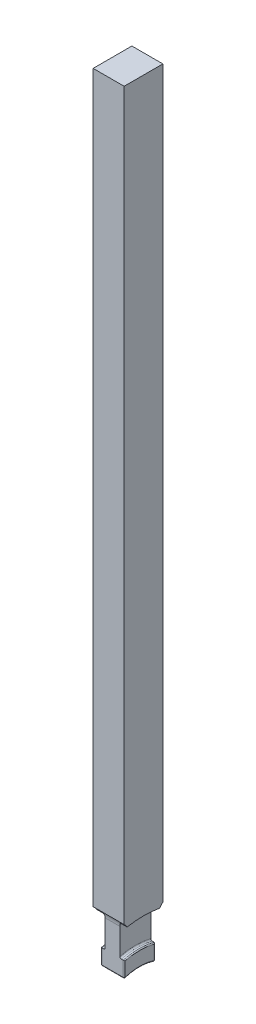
ISO-10303-21;
HEADER;
FILE_DESCRIPTION(('STEP AP214'),'2;1');
FILE_NAME('part.step','',(''),(''),'','','');
FILE_SCHEMA(('AUTOMOTIVE_DESIGN { 1 0 10303 214 1 1 1 1 }'));
ENDSEC;
DATA;
#1=APPLICATION_CONTEXT('core data for automotive mechanical design processes');
#2=APPLICATION_PROTOCOL_DEFINITION('international standard','automotive_design',2000,#1);
#3=PRODUCT_CONTEXT('',#1,'mechanical');
#4=PRODUCT('Part','Part','',(#3));
#5=PRODUCT_RELATED_PRODUCT_CATEGORY('part','',(#4));
#6=PRODUCT_DEFINITION_FORMATION('','',#4);
#7=PRODUCT_DEFINITION_CONTEXT('part definition',#1,'design');
#8=PRODUCT_DEFINITION('design','',#6,#7);
#9=PRODUCT_DEFINITION_SHAPE('','',#8);
#10=(LENGTH_UNIT() NAMED_UNIT(*) SI_UNIT(.MILLI.,.METRE.));
#11=(NAMED_UNIT(*) PLANE_ANGLE_UNIT() SI_UNIT($,.RADIAN.));
#12=(NAMED_UNIT(*) SI_UNIT($,.STERADIAN.) SOLID_ANGLE_UNIT());
#13=UNCERTAINTY_MEASURE_WITH_UNIT(LENGTH_MEASURE(1.E-05),#10,'distance_accuracy_value','');
#14=(GEOMETRIC_REPRESENTATION_CONTEXT(3) GLOBAL_UNCERTAINTY_ASSIGNED_CONTEXT((#13)) GLOBAL_UNIT_ASSIGNED_CONTEXT((#10,
#11,#12)) REPRESENTATION_CONTEXT('',''));
#15=CARTESIAN_POINT('',(0.,0.,0.));
#16=DIRECTION('',(0.,0.,1.));
#17=DIRECTION('',(1.,0.,0.));
#18=AXIS2_PLACEMENT_3D('',#15,#16,#17);
#19=CARTESIAN_POINT('',(4.,212.,4.99999999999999));
#20=DIRECTION('',(0.,0.,-1.));
#21=DIRECTION('',(0.,1.,0.));
#22=AXIS2_PLACEMENT_3D('',#19,#20,#21);
#23=PLANE('',#22);
#24=DIRECTION('',(0.,-1.,0.));
#25=VECTOR('',#24,1.);
#26=CARTESIAN_POINT('',(-4.,212.,4.99999999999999));
#27=LINE('',#26,#25);
#28=CARTESIAN_POINT('',(-4.,212.,4.99999999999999));
#29=VERTEX_POINT('',#28);
#30=CARTESIAN_POINT('',(-4.00000000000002,24.5553873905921,4.99999999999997));
#31=VERTEX_POINT('',#30);
#32=EDGE_CURVE('E247',#29,#31,#27,.T.);
#33=ORIENTED_EDGE('',*,*,#32,.T.);
#34=DIRECTION('',(1.,0.,0.));
#35=VECTOR('',#34,1.);
#36=CARTESIAN_POINT('',(-4.00000000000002,24.5553873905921,4.99999999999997));
#37=LINE('',#36,#35);
#38=CARTESIAN_POINT('',(4.00000000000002,24.5553873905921,4.99999999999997));
#39=VERTEX_POINT('',#38);
#40=EDGE_CURVE('E382',#31,#39,#37,.T.);
#41=ORIENTED_EDGE('',*,*,#40,.T.);
#42=DIRECTION('',(0.,-1.,0.));
#43=VECTOR('',#42,1.);
#44=CARTESIAN_POINT('',(4.,212.,4.99999999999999));
#45=LINE('',#44,#43);
#46=CARTESIAN_POINT('',(4.,212.,4.99999999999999));
#47=VERTEX_POINT('',#46);
#48=EDGE_CURVE('E237',#47,#39,#45,.T.);
#49=ORIENTED_EDGE('',*,*,#48,.F.);
#50=DIRECTION('',(-1.,0.,0.));
#51=VECTOR('',#50,1.);
#52=CARTESIAN_POINT('',(4.,212.,4.99999999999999));
#53=LINE('',#52,#51);
#54=EDGE_CURVE('E228',#47,#29,#53,.T.);
#55=ORIENTED_EDGE('',*,*,#54,.T.);
#56=EDGE_LOOP('',(#33,#41,#49,#55));
#57=FACE_BOUND('',#56,.T.);
#58=ADVANCED_FACE('F37',(#57),#23,.F.);
#59=CARTESIAN_POINT('',(4.,212.,-5.));
#60=DIRECTION('',(0.,0.,1.));
#61=DIRECTION('',(0.,-1.,0.));
#62=AXIS2_PLACEMENT_3D('',#59,#60,#61);
#63=PLANE('',#62);
#64=DIRECTION('',(0.,1.,0.));
#65=VECTOR('',#64,1.);
#66=CARTESIAN_POINT('',(4.,212.,-5.));
#67=LINE('',#66,#65);
#68=CARTESIAN_POINT('',(4.00000000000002,24.5553873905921,-5.00000000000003));
#69=VERTEX_POINT('',#68);
#70=CARTESIAN_POINT('',(4.,212.,-5.));
#71=VERTEX_POINT('',#70);
#72=EDGE_CURVE('E259',#69,#71,#67,.T.);
#73=ORIENTED_EDGE('',*,*,#72,.F.);
#74=DIRECTION('',(1.,0.,0.));
#75=VECTOR('',#74,1.);
#76=CARTESIAN_POINT('',(-4.00000000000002,24.5553873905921,-5.00000000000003));
#77=LINE('',#76,#75);
#78=CARTESIAN_POINT('',(-4.00000000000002,24.5553873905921,-5.00000000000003));
#79=VERTEX_POINT('',#78);
#80=EDGE_CURVE('E413',#69,#79,#77,.F.);
#81=ORIENTED_EDGE('',*,*,#80,.T.);
#82=DIRECTION('',(0.,1.,0.));
#83=VECTOR('',#82,1.);
#84=CARTESIAN_POINT('',(-4.,212.,-5.));
#85=LINE('',#84,#83);
#86=CARTESIAN_POINT('',(-4.,212.,-5.));
#87=VERTEX_POINT('',#86);
#88=EDGE_CURVE('E257',#79,#87,#85,.T.);
#89=ORIENTED_EDGE('',*,*,#88,.T.);
#90=DIRECTION('',(-1.,0.,0.));
#91=VECTOR('',#90,1.);
#92=CARTESIAN_POINT('',(4.,212.,-5.));
#93=LINE('',#92,#91);
#94=EDGE_CURVE('E260',#71,#87,#93,.T.);
#95=ORIENTED_EDGE('',*,*,#94,.F.);
#96=EDGE_LOOP('',(#73,#81,#89,#95));
#97=FACE_BOUND('',#96,.T.);
#98=ADVANCED_FACE('F374',(#97),#63,.F.);
#99=CARTESIAN_POINT('',(-4.,0.,0.));
#100=DIRECTION('',(-1.,0.,0.));
#101=DIRECTION('',(0.,0.,1.));
#102=AXIS2_PLACEMENT_3D('',#99,#100,#101);
#103=PLANE('',#102);
#104=CARTESIAN_POINT('',(-4.00000000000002,22.6124,-6.3876));
#105=DIRECTION('',(1.,0.,0.));
#106=DIRECTION('',(0.,0.,1.));
#107=AXIS2_PLACEMENT_3D('',#104,#105,#106);
#108=CIRCLE('',#107,2.3876);
#109=CARTESIAN_POINT('',(-4.00000000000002,23.6251112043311,-4.22541365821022));
#110=VERTEX_POINT('',#109);
#111=EDGE_CURVE('E439',#79,#110,#108,.T.);
#112=ORIENTED_EDGE('',*,*,#111,.T.);
#113=CARTESIAN_POINT('',(-4.00000000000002,0.,0.));
#114=DIRECTION('',(-1.,0.,0.));
#115=DIRECTION('',(0.,0.,1.));
#116=AXIS2_PLACEMENT_3D('',#113,#114,#115);
#117=CIRCLE('',#116,24.);
#118=CARTESIAN_POINT('',(-4.00000000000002,23.6251112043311,4.22541365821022));
#119=VERTEX_POINT('',#118);
#120=EDGE_CURVE('E244',#119,#110,#117,.T.);
#121=ORIENTED_EDGE('',*,*,#120,.F.);
#122=CARTESIAN_POINT('',(-4.00000000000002,22.6124,6.3876));
#123=DIRECTION('',(1.,0.,0.));
#124=DIRECTION('',(0.,0.,-1.));
#125=AXIS2_PLACEMENT_3D('',#122,#123,#124);
#126=CIRCLE('',#125,2.3876);
#127=EDGE_CURVE('E238',#119,#31,#126,.T.);
#128=ORIENTED_EDGE('',*,*,#127,.T.);
#129=ORIENTED_EDGE('',*,*,#32,.F.);
#130=DIRECTION('',(0.,0.,1.));
#131=VECTOR('',#130,1.);
#132=CARTESIAN_POINT('',(-4.,212.,4.99999999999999));
#133=LINE('',#132,#131);
#134=EDGE_CURVE('E243',#87,#29,#133,.T.);
#135=ORIENTED_EDGE('',*,*,#134,.F.);
#136=ORIENTED_EDGE('',*,*,#88,.F.);
#137=EDGE_LOOP('',(#112,#121,#128,#129,#135,#136));
#138=FACE_BOUND('',#137,.T.);
#139=ADVANCED_FACE('F371',(#138),#103,.T.);
#140=CARTESIAN_POINT('',(4.,212.,4.99999999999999));
#141=DIRECTION('',(0.,-1.,0.));
#142=DIRECTION('',(0.,0.,-1.));
#143=AXIS2_PLACEMENT_3D('',#140,#141,#142);
#144=PLANE('',#143);
#145=ORIENTED_EDGE('',*,*,#134,.T.);
#146=ORIENTED_EDGE('',*,*,#54,.F.);
#147=DIRECTION('',(0.,0.,1.));
#148=VECTOR('',#147,1.);
#149=CARTESIAN_POINT('',(4.,212.,4.99999999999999));
#150=LINE('',#149,#148);
#151=EDGE_CURVE('E255',#71,#47,#150,.T.);
#152=ORIENTED_EDGE('',*,*,#151,.F.);
#153=ORIENTED_EDGE('',*,*,#94,.T.);
#154=EDGE_LOOP('',(#145,#146,#152,#153));
#155=FACE_BOUND('',#154,.T.);
#156=ADVANCED_FACE('F311',(#155),#144,.F.);
#157=CARTESIAN_POINT('',(4.,0.,0.));
#158=DIRECTION('',(-1.,0.,0.));
#159=DIRECTION('',(0.,0.,1.));
#160=AXIS2_PLACEMENT_3D('',#157,#158,#159);
#161=PLANE('',#160);
#162=CARTESIAN_POINT('',(4.00000000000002,0.,0.));
#163=DIRECTION('',(-1.,0.,0.));
#164=DIRECTION('',(0.,0.,1.));
#165=AXIS2_PLACEMENT_3D('',#162,#163,#164);
#166=CIRCLE('',#165,24.);
#167=CARTESIAN_POINT('',(4.00000000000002,23.6251112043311,4.22541365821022));
#168=VERTEX_POINT('',#167);
#169=CARTESIAN_POINT('',(4.00000000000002,23.6251112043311,-4.22541365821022));
#170=VERTEX_POINT('',#169);
#171=EDGE_CURVE('E235',#168,#170,#166,.T.);
#172=ORIENTED_EDGE('',*,*,#171,.T.);
#173=CARTESIAN_POINT('',(4.00000000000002,22.6124,-6.3876));
#174=DIRECTION('',(1.,0.,0.));
#175=DIRECTION('',(0.,0.,1.));
#176=AXIS2_PLACEMENT_3D('',#173,#174,#175);
#177=CIRCLE('',#176,2.3876);
#178=EDGE_CURVE('E394',#69,#170,#177,.T.);
#179=ORIENTED_EDGE('',*,*,#178,.F.);
#180=ORIENTED_EDGE('',*,*,#72,.T.);
#181=ORIENTED_EDGE('',*,*,#151,.T.);
#182=ORIENTED_EDGE('',*,*,#48,.T.);
#183=CARTESIAN_POINT('',(4.00000000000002,22.6124,6.3876));
#184=DIRECTION('',(1.,0.,0.));
#185=DIRECTION('',(0.,0.,-1.));
#186=AXIS2_PLACEMENT_3D('',#183,#184,#185);
#187=CIRCLE('',#186,2.3876);
#188=EDGE_CURVE('E218',#168,#39,#187,.T.);
#189=ORIENTED_EDGE('',*,*,#188,.F.);
#190=EDGE_LOOP('',(#172,#179,#180,#181,#182,#189));
#191=FACE_BOUND('',#190,.T.);
#192=ADVANCED_FACE('F233',(#191),#161,.F.);
#193=CARTESIAN_POINT('',(-4.,0.,0.));
#194=DIRECTION('',(1.,0.,0.));
#195=DIRECTION('',(0.,0.,-1.));
#196=AXIS2_PLACEMENT_3D('',#193,#194,#195);
#197=CYLINDRICAL_SURFACE('',#196,12.);
#198=CARTESIAN_POINT('',(-2.746,0.,0.));
#199=DIRECTION('',(1.,0.,0.));
#200=DIRECTION('',(0.,1.,0.));
#201=AXIS2_PLACEMENT_3D('',#198,#199,#200);
#202=CIRCLE('',#201,12.);
#203=CARTESIAN_POINT('',(-2.746,11.4255496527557,3.66835319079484));
#204=VERTEX_POINT('',#203);
#205=CARTESIAN_POINT('',(-2.746,11.4255496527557,-3.66835319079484));
#206=VERTEX_POINT('',#205);
#207=EDGE_CURVE('E611',#204,#206,#202,.F.);
#208=ORIENTED_EDGE('',*,*,#207,.T.);
#209=DIRECTION('',(1.,0.,0.));
#210=VECTOR('',#209,1.);
#211=CARTESIAN_POINT('',(-4.,11.4255496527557,-3.66835319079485));
#212=LINE('',#211,#210);
#213=CARTESIAN_POINT('',(2.746,11.4255496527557,-3.66835319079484));
#214=VERTEX_POINT('',#213);
#215=EDGE_CURVE('E606',#206,#214,#212,.T.);
#216=ORIENTED_EDGE('',*,*,#215,.T.);
#217=CARTESIAN_POINT('',(2.746,0.,0.));
#218=DIRECTION('',(-1.,0.,0.));
#219=DIRECTION('',(0.,-1.,0.));
#220=AXIS2_PLACEMENT_3D('',#217,#218,#219);
#221=CIRCLE('',#220,12.);
#222=CARTESIAN_POINT('',(2.746,11.4255496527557,3.66835319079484));
#223=VERTEX_POINT('',#222);
#224=EDGE_CURVE('E608',#214,#223,#221,.F.);
#225=ORIENTED_EDGE('',*,*,#224,.T.);
#226=DIRECTION('',(1.,0.,0.));
#227=VECTOR('',#226,1.);
#228=CARTESIAN_POINT('',(-4.,11.4255496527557,3.66835319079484));
#229=LINE('',#228,#227);
#230=EDGE_CURVE('E613',#223,#204,#229,.F.);
#231=ORIENTED_EDGE('',*,*,#230,.T.);
#232=EDGE_LOOP('',(#208,#216,#225,#231));
#233=FACE_BOUND('',#232,.T.);
#234=ADVANCED_FACE('F358',(#233),#197,.F.);
#235=CARTESIAN_POINT('',(-1.905,16.,0.));
#236=DIRECTION('',(-1.,0.,0.));
#237=DIRECTION('',(0.,0.,1.));
#238=AXIS2_PLACEMENT_3D('',#235,#236,#237);
#239=PLANE('',#238);
#240=DIRECTION('',(0.,1.,0.));
#241=VECTOR('',#240,1.);
#242=CARTESIAN_POINT('',(-1.905,16.,-4.));
#243=LINE('',#242,#241);
#244=CARTESIAN_POINT('',(-1.905,15.8851238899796,-4.));
#245=VERTEX_POINT('',#244);
#246=CARTESIAN_POINT('',(-1.905,22.6124,-4.));
#247=VERTEX_POINT('',#246);
#248=EDGE_CURVE('E250',#245,#247,#243,.T.);
#249=ORIENTED_EDGE('',*,*,#248,.F.);
#250=CARTESIAN_POINT('',(-1.905,0.,0.));
#251=DIRECTION('',(-1.,0.,0.));
#252=DIRECTION('',(0.,0.,1.));
#253=AXIS2_PLACEMENT_3D('',#250,#251,#252);
#254=CIRCLE('',#253,16.381);
#255=CARTESIAN_POINT('',(-1.905,15.8851238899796,4.));
#256=VERTEX_POINT('',#255);
#257=EDGE_CURVE('E471',#245,#256,#254,.F.);
#258=ORIENTED_EDGE('',*,*,#257,.T.);
#259=DIRECTION('',(0.,-1.,0.));
#260=VECTOR('',#259,1.);
#261=CARTESIAN_POINT('',(-1.905,16.,4.));
#262=LINE('',#261,#260);
#263=CARTESIAN_POINT('',(-1.905,22.6124,4.));
#264=VERTEX_POINT('',#263);
#265=EDGE_CURVE('E421',#264,#256,#262,.T.);
#266=ORIENTED_EDGE('',*,*,#265,.F.);
#267=CARTESIAN_POINT('',(-1.905,22.6124,6.3876));
#268=DIRECTION('',(-1.,0.,0.));
#269=DIRECTION('',(0.,0.,1.));
#270=AXIS2_PLACEMENT_3D('',#267,#268,#269);
#271=CIRCLE('',#270,2.3876);
#272=CARTESIAN_POINT('',(-1.905,22.8883461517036,4.01599980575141));
#273=VERTEX_POINT('',#272);
#274=EDGE_CURVE('E403',#273,#264,#271,.T.);
#275=ORIENTED_EDGE('',*,*,#274,.F.);
#276=CARTESIAN_POINT('',(-1.905,0.,0.));
#277=DIRECTION('',(-1.,0.,0.));
#278=DIRECTION('',(0.,0.,1.));
#279=AXIS2_PLACEMENT_3D('',#276,#277,#278);
#280=CIRCLE('',#279,23.238);
#281=CARTESIAN_POINT('',(-1.905,22.8883461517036,-4.01599980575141));
#282=VERTEX_POINT('',#281);
#283=EDGE_CURVE('E275',#273,#282,#280,.T.);
#284=ORIENTED_EDGE('',*,*,#283,.T.);
#285=CARTESIAN_POINT('',(-1.905,22.6124,-6.3876));
#286=DIRECTION('',(-1.,0.,0.));
#287=DIRECTION('',(0.,0.,1.));
#288=AXIS2_PLACEMENT_3D('',#285,#286,#287);
#289=CIRCLE('',#288,2.3876);
#290=EDGE_CURVE('E410',#247,#282,#289,.T.);
#291=ORIENTED_EDGE('',*,*,#290,.F.);
#292=EDGE_LOOP('',(#249,#258,#266,#275,#284,#291));
#293=FACE_BOUND('',#292,.T.);
#294=ADVANCED_FACE('F354',(#293),#239,.T.);
#295=CARTESIAN_POINT('',(-8.84822894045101,0.,0.));
#296=DIRECTION('',(-1.,0.,0.));
#297=DIRECTION('',(0.,0.,1.));
#298=AXIS2_PLACEMENT_3D('',#295,#296,#297);
#299=CYLINDRICAL_SURFACE('',#298,24.);
#300=DIRECTION('',(1.,0.,0.));
#301=VECTOR('',#300,1.);
#302=CARTESIAN_POINT('',(-2.95250000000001,23.6251112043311,-4.22541365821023));
#303=LINE('',#302,#301);
#304=CARTESIAN_POINT('',(-2.667,23.6251112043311,-4.22541365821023));
#305=VERTEX_POINT('',#304);
#306=EDGE_CURVE('E408',#305,#110,#303,.F.);
#307=ORIENTED_EDGE('',*,*,#306,.F.);
#308=CARTESIAN_POINT('',(-2.667,0.,0.));
#309=DIRECTION('',(-1.,0.,0.));
#310=DIRECTION('',(0.,0.,1.));
#311=AXIS2_PLACEMENT_3D('',#308,#309,#310);
#312=CIRCLE('',#311,24.);
#313=CARTESIAN_POINT('',(-2.667,23.6251112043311,4.22541365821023));
#314=VERTEX_POINT('',#313);
#315=EDGE_CURVE('E278',#305,#314,#312,.F.);
#316=ORIENTED_EDGE('',*,*,#315,.T.);
#317=DIRECTION('',(1.,0.,0.));
#318=VECTOR('',#317,1.);
#319=CARTESIAN_POINT('',(-2.95250000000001,23.6251112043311,4.22541365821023));
#320=LINE('',#319,#318);
#321=EDGE_CURVE('E400',#119,#314,#320,.T.);
#322=ORIENTED_EDGE('',*,*,#321,.F.);
#323=ORIENTED_EDGE('',*,*,#120,.T.);
#324=EDGE_LOOP('',(#307,#316,#322,#323));
#325=FACE_BOUND('',#324,.T.);
#326=ADVANCED_FACE('F357',(#325),#299,.F.);
#327=CARTESIAN_POINT('',(-8.84822894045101,0.,0.));
#328=DIRECTION('',(-1.,0.,0.));
#329=DIRECTION('',(0.,0.,1.));
#330=AXIS2_PLACEMENT_3D('',#327,#328,#329);
#331=CYLINDRICAL_SURFACE('',#330,16.);
#332=DIRECTION('',(-1.,0.,0.));
#333=VECTOR('',#332,1.);
#334=CARTESIAN_POINT('',(-8.84822894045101,15.4919333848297,-4.));
#335=LINE('',#334,#333);
#336=CARTESIAN_POINT('',(-2.746,15.4919333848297,-4.));
#337=VERTEX_POINT('',#336);
#338=CARTESIAN_POINT('',(-2.286,15.4919333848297,-4.));
#339=VERTEX_POINT('',#338);
#340=EDGE_CURVE('E426',#337,#339,#335,.F.);
#341=ORIENTED_EDGE('',*,*,#340,.F.);
#342=CARTESIAN_POINT('',(-2.746,0.,0.));
#343=DIRECTION('',(1.,0.,0.));
#344=DIRECTION('',(0.,1.,0.));
#345=AXIS2_PLACEMENT_3D('',#342,#343,#344);
#346=CIRCLE('',#345,16.);
#347=CARTESIAN_POINT('',(-2.746,15.4919333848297,4.));
#348=VERTEX_POINT('',#347);
#349=EDGE_CURVE('E11',#337,#348,#346,.T.);
#350=ORIENTED_EDGE('',*,*,#349,.T.);
#351=DIRECTION('',(-1.,0.,0.));
#352=VECTOR('',#351,1.);
#353=CARTESIAN_POINT('',(-8.84822894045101,15.4919333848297,4.));
#354=LINE('',#353,#352);
#355=CARTESIAN_POINT('',(-2.286,15.4919333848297,4.));
#356=VERTEX_POINT('',#355);
#357=EDGE_CURVE('E418',#356,#348,#354,.T.);
#358=ORIENTED_EDGE('',*,*,#357,.F.);
#359=CARTESIAN_POINT('',(-2.286,0.,0.));
#360=DIRECTION('',(-1.,0.,0.));
#361=DIRECTION('',(0.,0.,1.));
#362=AXIS2_PLACEMENT_3D('',#359,#360,#361);
#363=CIRCLE('',#362,16.);
#364=EDGE_CURVE('E333',#356,#339,#363,.T.);
#365=ORIENTED_EDGE('',*,*,#364,.T.);
#366=EDGE_LOOP('',(#341,#350,#358,#365));
#367=FACE_BOUND('',#366,.T.);
#368=ADVANCED_FACE('F349',(#367),#331,.T.);
#369=CARTESIAN_POINT('',(1.905,16.,0.));
#370=DIRECTION('',(1.,0.,0.));
#371=DIRECTION('',(0.,0.,-1.));
#372=AXIS2_PLACEMENT_3D('',#369,#370,#371);
#373=PLANE('',#372);
#374=DIRECTION('',(0.,1.,0.));
#375=VECTOR('',#374,1.);
#376=CARTESIAN_POINT('',(1.905,16.,4.));
#377=LINE('',#376,#375);
#378=CARTESIAN_POINT('',(1.905,15.8851238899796,4.));
#379=VERTEX_POINT('',#378);
#380=CARTESIAN_POINT('',(1.905,22.6124,4.));
#381=VERTEX_POINT('',#380);
#382=EDGE_CURVE('E416',#379,#381,#377,.T.);
#383=ORIENTED_EDGE('',*,*,#382,.F.);
#384=CARTESIAN_POINT('',(1.905,0.,0.));
#385=DIRECTION('',(1.,0.,0.));
#386=DIRECTION('',(0.,0.,-1.));
#387=AXIS2_PLACEMENT_3D('',#384,#385,#386);
#388=CIRCLE('',#387,16.381);
#389=CARTESIAN_POINT('',(1.905,15.8851238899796,-4.));
#390=VERTEX_POINT('',#389);
#391=EDGE_CURVE('E452',#379,#390,#388,.F.);
#392=ORIENTED_EDGE('',*,*,#391,.T.);
#393=DIRECTION('',(0.,-1.,0.));
#394=VECTOR('',#393,1.);
#395=CARTESIAN_POINT('',(1.905,16.,-4.));
#396=LINE('',#395,#394);
#397=CARTESIAN_POINT('',(1.905,22.6124,-4.));
#398=VERTEX_POINT('',#397);
#399=EDGE_CURVE('E424',#398,#390,#396,.T.);
#400=ORIENTED_EDGE('',*,*,#399,.F.);
#401=CARTESIAN_POINT('',(1.905,22.6124,-6.3876));
#402=DIRECTION('',(1.,0.,0.));
#403=DIRECTION('',(0.,0.,-1.));
#404=AXIS2_PLACEMENT_3D('',#401,#402,#403);
#405=CIRCLE('',#404,2.3876);
#406=CARTESIAN_POINT('',(1.905,22.8883461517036,-4.01599980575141));
#407=VERTEX_POINT('',#406);
#408=EDGE_CURVE('E406',#407,#398,#405,.T.);
#409=ORIENTED_EDGE('',*,*,#408,.F.);
#410=CARTESIAN_POINT('',(1.905,0.,0.));
#411=DIRECTION('',(1.,0.,0.));
#412=DIRECTION('',(0.,0.,-1.));
#413=AXIS2_PLACEMENT_3D('',#410,#411,#412);
#414=CIRCLE('',#413,23.238);
#415=CARTESIAN_POINT('',(1.905,22.8883461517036,4.01599980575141));
#416=VERTEX_POINT('',#415);
#417=EDGE_CURVE('E282',#407,#416,#414,.T.);
#418=ORIENTED_EDGE('',*,*,#417,.T.);
#419=CARTESIAN_POINT('',(1.905,22.6124,6.3876));
#420=DIRECTION('',(1.,0.,0.));
#421=DIRECTION('',(0.,0.,-1.));
#422=AXIS2_PLACEMENT_3D('',#419,#420,#421);
#423=CIRCLE('',#422,2.3876);
#424=EDGE_CURVE('E398',#381,#416,#423,.T.);
#425=ORIENTED_EDGE('',*,*,#424,.F.);
#426=EDGE_LOOP('',(#383,#392,#400,#409,#418,#425));
#427=FACE_BOUND('',#426,.T.);
#428=ADVANCED_FACE('F346',(#427),#373,.T.);
#429=CARTESIAN_POINT('',(-8.84822894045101,0.,0.));
#430=DIRECTION('',(-1.,0.,0.));
#431=DIRECTION('',(0.,0.,1.));
#432=AXIS2_PLACEMENT_3D('',#429,#430,#431);
#433=CYLINDRICAL_SURFACE('',#432,16.);
#434=DIRECTION('',(-1.,0.,0.));
#435=VECTOR('',#434,1.);
#436=CARTESIAN_POINT('',(-8.84822894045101,15.4919333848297,4.));
#437=LINE('',#436,#435);
#438=CARTESIAN_POINT('',(2.746,15.4919333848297,4.));
#439=VERTEX_POINT('',#438);
#440=CARTESIAN_POINT('',(2.286,15.4919333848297,4.));
#441=VERTEX_POINT('',#440);
#442=EDGE_CURVE('E270',#439,#441,#437,.T.);
#443=ORIENTED_EDGE('',*,*,#442,.F.);
#444=CARTESIAN_POINT('',(2.746,0.,0.));
#445=DIRECTION('',(-1.,0.,0.));
#446=DIRECTION('',(0.,-1.,0.));
#447=AXIS2_PLACEMENT_3D('',#444,#445,#446);
#448=CIRCLE('',#447,16.);
#449=CARTESIAN_POINT('',(2.746,15.4919333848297,-4.));
#450=VERTEX_POINT('',#449);
#451=EDGE_CURVE('E467',#439,#450,#448,.T.);
#452=ORIENTED_EDGE('',*,*,#451,.T.);
#453=DIRECTION('',(-1.,0.,0.));
#454=VECTOR('',#453,1.);
#455=CARTESIAN_POINT('',(-8.84822894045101,15.4919333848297,-4.));
#456=LINE('',#455,#454);
#457=CARTESIAN_POINT('',(2.286,15.4919333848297,-4.));
#458=VERTEX_POINT('',#457);
#459=EDGE_CURVE('E272',#458,#450,#456,.F.);
#460=ORIENTED_EDGE('',*,*,#459,.F.);
#461=CARTESIAN_POINT('',(2.286,0.,0.));
#462=DIRECTION('',(1.,0.,0.));
#463=DIRECTION('',(0.,0.,-1.));
#464=AXIS2_PLACEMENT_3D('',#461,#462,#463);
#465=CIRCLE('',#464,16.);
#466=EDGE_CURVE('E464',#458,#441,#465,.T.);
#467=ORIENTED_EDGE('',*,*,#466,.T.);
#468=EDGE_LOOP('',(#443,#452,#460,#467));
#469=FACE_BOUND('',#468,.T.);
#470=ADVANCED_FACE('F345',(#469),#433,.T.);
#471=CARTESIAN_POINT('',(-8.84822894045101,0.,0.));
#472=DIRECTION('',(-1.,0.,0.));
#473=DIRECTION('',(0.,0.,1.));
#474=AXIS2_PLACEMENT_3D('',#471,#472,#473);
#475=CYLINDRICAL_SURFACE('',#474,24.);
#476=DIRECTION('',(1.,0.,0.));
#477=VECTOR('',#476,1.);
#478=CARTESIAN_POINT('',(2.95250000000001,23.6251112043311,4.22541365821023));
#479=LINE('',#478,#477);
#480=CARTESIAN_POINT('',(2.667,23.6251112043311,4.22541365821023));
#481=VERTEX_POINT('',#480);
#482=EDGE_CURVE('E215',#481,#168,#479,.T.);
#483=ORIENTED_EDGE('',*,*,#482,.F.);
#484=CARTESIAN_POINT('',(2.667,0.,0.));
#485=DIRECTION('',(1.,0.,0.));
#486=DIRECTION('',(0.,0.,-1.));
#487=AXIS2_PLACEMENT_3D('',#484,#485,#486);
#488=CIRCLE('',#487,24.);
#489=CARTESIAN_POINT('',(2.667,23.6251112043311,-4.22541365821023));
#490=VERTEX_POINT('',#489);
#491=EDGE_CURVE('E280',#481,#490,#488,.F.);
#492=ORIENTED_EDGE('',*,*,#491,.T.);
#493=DIRECTION('',(1.,0.,0.));
#494=VECTOR('',#493,1.);
#495=CARTESIAN_POINT('',(2.95250000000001,23.6251112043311,-4.22541365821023));
#496=LINE('',#495,#494);
#497=EDGE_CURVE('E227',#170,#490,#496,.F.);
#498=ORIENTED_EDGE('',*,*,#497,.F.);
#499=ORIENTED_EDGE('',*,*,#171,.F.);
#500=EDGE_LOOP('',(#483,#492,#498,#499));
#501=FACE_BOUND('',#500,.T.);
#502=ADVANCED_FACE('F241',(#501),#475,.F.);
#503=CARTESIAN_POINT('',(-4.00000000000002,0.,4.));
#504=DIRECTION('',(0.,0.,-1.));
#505=DIRECTION('',(0.,1.,0.));
#506=AXIS2_PLACEMENT_3D('',#503,#504,#505);
#507=PLANE('',#506);
#508=DIRECTION('',(1.,0.,0.));
#509=VECTOR('',#508,1.);
#510=CARTESIAN_POINT('',(-4.00000000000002,11.667390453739,4.));
#511=LINE('',#510,#509);
#512=CARTESIAN_POINT('',(-2.746,11.667390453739,4.));
#513=VERTEX_POINT('',#512);
#514=CARTESIAN_POINT('',(2.746,11.667390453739,4.));
#515=VERTEX_POINT('',#514);
#516=EDGE_CURVE('E604',#513,#515,#511,.T.);
#517=ORIENTED_EDGE('',*,*,#516,.T.);
#518=DIRECTION('',(0.,1.,0.));
#519=VECTOR('',#518,1.);
#520=CARTESIAN_POINT('',(2.746,0.,4.));
#521=LINE('',#520,#519);
#522=EDGE_CURVE('E601',#515,#439,#521,.T.);
#523=ORIENTED_EDGE('',*,*,#522,.T.);
#524=ORIENTED_EDGE('',*,*,#442,.T.);
#525=CARTESIAN_POINT('',(2.286,15.4919333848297,4.));
#526=CARTESIAN_POINT('',(2.26505345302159,15.4919123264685,4.));
#527=CARTESIAN_POINT('',(2.24411644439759,15.4937160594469,4.));
#528=CARTESIAN_POINT('',(2.20287726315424,15.5008127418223,4.));
#529=CARTESIAN_POINT('',(2.18257407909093,15.5060997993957,4.));
#530=CARTESIAN_POINT('',(2.14314050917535,15.5200048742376,4.));
#531=CARTESIAN_POINT('',(2.1240103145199,15.5286234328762,4.));
#532=CARTESIAN_POINT('',(2.08744051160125,15.5489055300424,4.));
#533=CARTESIAN_POINT('',(2.07000103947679,15.560569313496,4.));
#534=CARTESIAN_POINT('',(2.03703294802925,15.5867647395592,4.));
#535=CARTESIAN_POINT('',(2.02153414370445,15.6013338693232,4.));
#536=CARTESIAN_POINT('',(1.99311357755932,15.6328016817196,4.));
#537=CARTESIAN_POINT('',(1.98019244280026,15.6497009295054,4.));
#538=CARTESIAN_POINT('',(1.95688382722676,15.685888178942,4.));
#539=CARTESIAN_POINT('',(1.94658422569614,15.7052327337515,4.));
#540=CARTESIAN_POINT('',(1.92928032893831,15.7453418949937,4.));
#541=CARTESIAN_POINT('',(1.92227548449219,15.7661062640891,4.));
#542=CARTESIAN_POINT('',(1.91301062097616,15.8032848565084,4.));
#543=CARTESIAN_POINT('',(1.91000862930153,15.8195186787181,4.));
#544=CARTESIAN_POINT('',(1.90600324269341,15.8522080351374,4.));
#545=CARTESIAN_POINT('',(1.90499706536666,15.8686632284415,4.));
#546=CARTESIAN_POINT('',(1.905,15.8851238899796,4.));
#547=B_SPLINE_CURVE_WITH_KNOTS('',3,(#525,#526,#527,#528,#529,#530,#531,#532,#533,#534,#535,
#536,#537,#538,#539,#540,#541,#542,#543,#544,#545,#546),.UNSPECIFIED.,.F.,.F.,(4,2,2,2,2,2,2,2,
2,2,4),(0.,0.0627476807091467,0.125389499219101,0.188041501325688,0.250698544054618,
0.314223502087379,0.377763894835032,0.443215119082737,0.508655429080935,0.558065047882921,
0.607405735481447),.UNSPECIFIED.);
#548=EDGE_CURVE('E459',#441,#379,#547,.T.);
#549=ORIENTED_EDGE('',*,*,#548,.T.);
#550=ORIENTED_EDGE('',*,*,#382,.T.);
#551=DIRECTION('',(1.,0.,0.));
#552=VECTOR('',#551,1.);
#553=CARTESIAN_POINT('',(-4.00000000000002,22.6124,4.));
#554=LINE('',#553,#552);
#555=EDGE_CURVE('E391',#264,#381,#554,.T.);
#556=ORIENTED_EDGE('',*,*,#555,.F.);
#557=ORIENTED_EDGE('',*,*,#265,.T.);
#558=CARTESIAN_POINT('',(-1.905,15.8851238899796,4.));
#559=CARTESIAN_POINT('',(-1.90498430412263,15.8624862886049,4.));
#560=CARTESIAN_POINT('',(-1.90689645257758,15.8398505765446,4.));
#561=CARTESIAN_POINT('',(-1.91446209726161,15.7952103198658,4.));
#562=CARTESIAN_POINT('',(-1.92011603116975,15.7732058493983,4.));
#563=CARTESIAN_POINT('',(-1.93505651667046,15.730444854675,4.));
#564=CARTESIAN_POINT('',(-1.94434581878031,15.7096892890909,4.));
#565=CARTESIAN_POINT('',(-1.96632157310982,15.6700698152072,4.));
#566=CARTESIAN_POINT('',(-1.97900659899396,15.6512051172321,4.));
#567=CARTESIAN_POINT('',(-2.00724687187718,15.6162013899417,4.));
#568=CARTESIAN_POINT('',(-2.02275886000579,15.6000274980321,4.));
#569=CARTESIAN_POINT('',(-2.0563576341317,15.5706079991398,4.));
#570=CARTESIAN_POINT('',(-2.07444470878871,15.5573627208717,4.));
#571=CARTESIAN_POINT('',(-2.1120952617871,15.5346089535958,4.));
#572=CARTESIAN_POINT('',(-2.13159852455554,15.525000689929,4.));
#573=CARTESIAN_POINT('',(-2.17196646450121,15.5093128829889,4.));
#574=CARTESIAN_POINT('',(-2.1928296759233,15.503229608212,4.));
#575=CARTESIAN_POINT('',(-2.22589521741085,15.4966600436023,4.));
#576=CARTESIAN_POINT('',(-2.23785594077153,15.4948884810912,4.));
#577=CARTESIAN_POINT('',(-2.26187577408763,15.4925256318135,4.));
#578=CARTESIAN_POINT('',(-2.27393471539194,15.4919326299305,4.));
#579=CARTESIAN_POINT('',(-2.28599999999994,15.4919333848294,4.));
#580=B_SPLINE_CURVE_WITH_KNOTS('',3,(#558,#559,#560,#561,#562,#563,#564,#565,#566,#567,#568,
#569,#570,#571,#572,#573,#574,#575,#576,#577,#578,#579),.UNSPECIFIED.,.F.,.F.,(4,2,2,2,2,2,2,2,
2,2,4),(0.,0.0678302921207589,0.135668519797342,0.20355817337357,0.271419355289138,
0.338318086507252,0.40522432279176,0.470132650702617,0.534972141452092,0.571193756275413,
0.607362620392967),.UNSPECIFIED.);
#581=EDGE_CURVE('E460',#256,#356,#580,.T.);
#582=ORIENTED_EDGE('',*,*,#581,.T.);
#583=ORIENTED_EDGE('',*,*,#357,.T.);
#584=DIRECTION('',(0.,-1.,0.));
#585=VECTOR('',#584,1.);
#586=CARTESIAN_POINT('',(-2.746,0.,4.));
#587=LINE('',#586,#585);
#588=EDGE_CURVE('E594',#348,#513,#587,.T.);
#589=ORIENTED_EDGE('',*,*,#588,.T.);
#590=EDGE_LOOP('',(#517,#523,#524,#549,#550,#556,#557,#582,#583,#589));
#591=FACE_BOUND('',#590,.T.);
#592=ADVANCED_FACE('F340',(#591),#507,.F.);
#593=CARTESIAN_POINT('',(-4.00000000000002,22.6124,6.3876));
#594=DIRECTION('',(1.,0.,0.));
#595=DIRECTION('',(0.,0.,-1.));
#596=AXIS2_PLACEMENT_3D('',#593,#594,#595);
#597=CYLINDRICAL_SURFACE('',#596,2.3876);
#598=ORIENTED_EDGE('',*,*,#127,.F.);
#599=ORIENTED_EDGE('',*,*,#321,.T.);
#600=CARTESIAN_POINT('',(-2.667,23.6251112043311,4.22541365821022));
#601=CARTESIAN_POINT('',(-2.62483766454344,23.6251421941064,4.2254632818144));
#602=CARTESIAN_POINT('',(-2.58270439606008,23.6218336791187,4.22387879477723));
#603=CARTESIAN_POINT('',(-2.49975187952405,23.6087865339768,4.2178214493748));
#604=CARTESIAN_POINT('',(-2.45892988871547,23.5990623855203,4.21335509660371));
#605=CARTESIAN_POINT('',(-2.3796619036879,23.5734328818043,4.20191162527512));
#606=CARTESIAN_POINT('',(-2.34121553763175,23.5575284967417,4.19493490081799));
#607=CARTESIAN_POINT('',(-2.26767189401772,23.5199354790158,4.17910942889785));
#608=CARTESIAN_POINT('',(-2.23257590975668,23.4982446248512,4.17025996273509));
#609=CARTESIAN_POINT('',(-2.16591034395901,23.4490361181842,4.15122301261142));
#610=CARTESIAN_POINT('',(-2.13443288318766,23.4214031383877,4.14101083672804));
#611=CARTESIAN_POINT('',(-2.07672491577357,23.3612147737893,4.12023985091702));
#612=CARTESIAN_POINT('',(-2.05049494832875,23.3286588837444,4.10968100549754));
#613=CARTESIAN_POINT('',(-2.00383801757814,23.2590964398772,4.08896047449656));
#614=CARTESIAN_POINT('',(-1.98345985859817,23.2220559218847,4.07880270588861));
#615=CARTESIAN_POINT('',(-1.94945267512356,23.1447076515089,4.05975473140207));
#616=CARTESIAN_POINT('',(-1.93581813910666,23.1044025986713,4.05086349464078));
#617=CARTESIAN_POINT('',(-1.91887934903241,23.0346435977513,4.03745471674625));
#618=CARTESIAN_POINT('',(-1.9136788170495,23.0057312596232,4.03243839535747));
#619=CARTESIAN_POINT('',(-1.90673596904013,22.9473549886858,4.023425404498));
#620=CARTESIAN_POINT('',(-1.9049917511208,22.9178913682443,4.01942817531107));
#621=CARTESIAN_POINT('',(-1.905,22.8883461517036,4.01599980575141));
#622=B_SPLINE_CURVE_WITH_KNOTS('',3,(#600,#601,#602,#603,#604,#605,#606,#607,#608,#609,#610,
#611,#612,#613,#614,#615,#616,#617,#618,#619,#620,#621),.UNSPECIFIED.,.F.,.F.,(4,2,2,2,2,2,2,2,
2,2,4),(0.,0.126282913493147,0.252281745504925,0.378260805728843,0.504288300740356,
0.633027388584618,0.761779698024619,0.891576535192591,1.0212671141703,1.11046070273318,
1.19960519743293),.UNSPECIFIED.);
#623=EDGE_CURVE('E292',#314,#273,#622,.T.);
#624=ORIENTED_EDGE('',*,*,#623,.T.);
#625=ORIENTED_EDGE('',*,*,#274,.T.);
#626=ORIENTED_EDGE('',*,*,#555,.T.);
#627=ORIENTED_EDGE('',*,*,#424,.T.);
#628=CARTESIAN_POINT('',(1.905,22.8883461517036,4.01599980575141));
#629=CARTESIAN_POINT('',(1.9049566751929,22.9294772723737,4.02074598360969));
#630=CARTESIAN_POINT('',(1.90836039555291,22.9704532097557,4.02663624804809));
#631=CARTESIAN_POINT('',(1.92178914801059,23.0508892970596,4.04026731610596));
#632=CARTESIAN_POINT('',(1.9317985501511,23.0903527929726,4.04800372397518));
#633=CARTESIAN_POINT('',(1.95816890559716,23.1667651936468,4.06491629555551));
#634=CARTESIAN_POINT('',(1.97453022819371,23.2037139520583,4.07409254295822));
#635=CARTESIAN_POINT('',(2.01310412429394,23.2741917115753,4.09325966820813));
#636=CARTESIAN_POINT('',(2.03531856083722,23.3077196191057,4.10325080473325));
#637=CARTESIAN_POINT('',(2.08550833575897,23.3712510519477,4.12355131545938));
#638=CARTESIAN_POINT('',(2.11359409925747,23.4011665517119,4.13386298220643));
#639=CARTESIAN_POINT('',(2.17449912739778,23.4560005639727,4.15380845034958));
#640=CARTESIAN_POINT('',(2.20731975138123,23.4809176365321,4.16344205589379));
#641=CARTESIAN_POINT('',(2.27787900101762,23.5258497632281,4.18150650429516));
#642=CARTESIAN_POINT('',(2.31573252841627,23.5457019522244,4.1898944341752));
#643=CARTESIAN_POINT('',(2.39454730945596,23.5790318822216,4.20434831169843));
#644=CARTESIAN_POINT('',(2.43550628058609,23.5925142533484,4.21041594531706));
#645=CARTESIAN_POINT('',(2.50831557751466,23.6100838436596,4.21842273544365));
#646=CARTESIAN_POINT('',(2.53973109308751,23.6157089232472,4.22102778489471));
#647=CARTESIAN_POINT('',(2.60309165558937,23.6232260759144,4.22453074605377));
#648=CARTESIAN_POINT('',(2.63503659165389,23.6251189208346,4.22542901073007));
#649=CARTESIAN_POINT('',(2.667,23.6251112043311,4.22541365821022));
#650=B_SPLINE_CURVE_WITH_KNOTS('',3,(#628,#629,#630,#631,#632,#633,#634,#635,#636,#637,#638,
#639,#640,#641,#642,#643,#644,#645,#646,#647,#648,#649),.UNSPECIFIED.,.F.,.F.,(4,2,2,2,2,2,2,2,
2,2,4),(0.,0.124022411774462,0.24775241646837,0.371489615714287,0.49526624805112,
0.621622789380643,0.748015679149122,0.878069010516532,1.00802766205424,1.10383549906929,
1.19962352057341),.UNSPECIFIED.);
#651=EDGE_CURVE('E222',#416,#481,#650,.T.);
#652=ORIENTED_EDGE('',*,*,#651,.T.);
#653=ORIENTED_EDGE('',*,*,#482,.T.);
#654=ORIENTED_EDGE('',*,*,#188,.T.);
#655=ORIENTED_EDGE('',*,*,#40,.F.);
#656=EDGE_LOOP('',(#598,#599,#624,#625,#626,#627,#652,#653,#654,#655));
#657=FACE_BOUND('',#656,.T.);
#658=ADVANCED_FACE('F217',(#657),#597,.F.);
#659=CARTESIAN_POINT('',(-4.00000000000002,0.,-4.));
#660=DIRECTION('',(0.,0.,1.));
#661=DIRECTION('',(1.,0.,0.));
#662=AXIS2_PLACEMENT_3D('',#659,#660,#661);
#663=PLANE('',#662);
#664=ORIENTED_EDGE('',*,*,#459,.T.);
#665=DIRECTION('',(0.,-1.,0.));
#666=VECTOR('',#665,1.);
#667=CARTESIAN_POINT('',(2.746,0.,-4.));
#668=LINE('',#667,#666);
#669=CARTESIAN_POINT('',(2.746,11.667390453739,-4.));
#670=VERTEX_POINT('',#669);
#671=EDGE_CURVE('E624',#450,#670,#668,.T.);
#672=ORIENTED_EDGE('',*,*,#671,.T.);
#673=DIRECTION('',(1.,0.,0.));
#674=VECTOR('',#673,1.);
#675=CARTESIAN_POINT('',(-4.00000000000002,11.667390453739,-4.));
#676=LINE('',#675,#674);
#677=CARTESIAN_POINT('',(-2.746,11.667390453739,-4.));
#678=VERTEX_POINT('',#677);
#679=EDGE_CURVE('E627',#670,#678,#676,.F.);
#680=ORIENTED_EDGE('',*,*,#679,.T.);
#681=DIRECTION('',(0.,1.,0.));
#682=VECTOR('',#681,1.);
#683=CARTESIAN_POINT('',(-2.746,0.,-4.));
#684=LINE('',#683,#682);
#685=EDGE_CURVE('E626',#678,#337,#684,.T.);
#686=ORIENTED_EDGE('',*,*,#685,.T.);
#687=ORIENTED_EDGE('',*,*,#340,.T.);
#688=CARTESIAN_POINT('',(-2.286,15.4919333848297,-4.));
#689=CARTESIAN_POINT('',(-2.26505345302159,15.4919123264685,-4.));
#690=CARTESIAN_POINT('',(-2.24411644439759,15.4937160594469,-4.));
#691=CARTESIAN_POINT('',(-2.20287726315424,15.5008127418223,-4.));
#692=CARTESIAN_POINT('',(-2.18257407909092,15.5060997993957,-4.));
#693=CARTESIAN_POINT('',(-2.14314050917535,15.5200048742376,-4.));
#694=CARTESIAN_POINT('',(-2.1240103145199,15.5286234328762,-4.));
#695=CARTESIAN_POINT('',(-2.08744051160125,15.5489055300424,-4.));
#696=CARTESIAN_POINT('',(-2.07000103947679,15.560569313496,-4.));
#697=CARTESIAN_POINT('',(-2.03703294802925,15.5867647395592,-4.));
#698=CARTESIAN_POINT('',(-2.02153414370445,15.6013338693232,-4.));
#699=CARTESIAN_POINT('',(-1.99311357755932,15.6328016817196,-4.));
#700=CARTESIAN_POINT('',(-1.98019244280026,15.6497009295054,-4.));
#701=CARTESIAN_POINT('',(-1.95688382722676,15.685888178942,-4.));
#702=CARTESIAN_POINT('',(-1.94658422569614,15.7052327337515,-4.));
#703=CARTESIAN_POINT('',(-1.9292803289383,15.7453418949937,-4.));
#704=CARTESIAN_POINT('',(-1.92227548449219,15.7661062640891,-4.));
#705=CARTESIAN_POINT('',(-1.91301062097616,15.8032848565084,-4.));
#706=CARTESIAN_POINT('',(-1.91000862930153,15.8195186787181,-4.));
#707=CARTESIAN_POINT('',(-1.90600324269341,15.8522080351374,-4.));
#708=CARTESIAN_POINT('',(-1.90499706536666,15.8686632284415,-4.));
#709=CARTESIAN_POINT('',(-1.905,15.8851238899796,-4.));
#710=B_SPLINE_CURVE_WITH_KNOTS('',3,(#688,#689,#690,#691,#692,#693,#694,#695,#696,#697,#698,
#699,#700,#701,#702,#703,#704,#705,#706,#707,#708,#709),.UNSPECIFIED.,.F.,.F.,(4,2,2,2,2,2,2,2,
2,2,4),(0.,0.0627476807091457,0.1253894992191,0.188041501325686,0.250698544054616,
0.314223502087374,0.377763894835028,0.443215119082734,0.508655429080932,0.558065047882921,
0.607405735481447),.UNSPECIFIED.);
#711=EDGE_CURVE('E434',#339,#245,#710,.T.);
#712=ORIENTED_EDGE('',*,*,#711,.T.);
#713=ORIENTED_EDGE('',*,*,#248,.T.);
#714=DIRECTION('',(1.,0.,0.));
#715=VECTOR('',#714,1.);
#716=CARTESIAN_POINT('',(-4.00000000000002,22.6124,-4.));
#717=LINE('',#716,#715);
#718=EDGE_CURVE('E401',#247,#398,#717,.T.);
#719=ORIENTED_EDGE('',*,*,#718,.T.);
#720=ORIENTED_EDGE('',*,*,#399,.T.);
#721=CARTESIAN_POINT('',(1.905,15.8851238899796,-4.));
#722=CARTESIAN_POINT('',(1.90498430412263,15.8624862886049,-4.));
#723=CARTESIAN_POINT('',(1.90689645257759,15.8398505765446,-4.));
#724=CARTESIAN_POINT('',(1.91446209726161,15.7952103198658,-4.));
#725=CARTESIAN_POINT('',(1.92011603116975,15.7732058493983,-4.));
#726=CARTESIAN_POINT('',(1.93505651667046,15.730444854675,-4.));
#727=CARTESIAN_POINT('',(1.94434581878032,15.7096892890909,-4.));
#728=CARTESIAN_POINT('',(1.96632157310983,15.6700698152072,-4.));
#729=CARTESIAN_POINT('',(1.97900659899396,15.6512051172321,-4.));
#730=CARTESIAN_POINT('',(2.00724687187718,15.6162013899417,-4.));
#731=CARTESIAN_POINT('',(2.02275886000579,15.6000274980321,-4.));
#732=CARTESIAN_POINT('',(2.0563576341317,15.5706079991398,-4.));
#733=CARTESIAN_POINT('',(2.07444470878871,15.5573627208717,-4.));
#734=CARTESIAN_POINT('',(2.1120952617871,15.5346089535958,-4.));
#735=CARTESIAN_POINT('',(2.13159852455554,15.525000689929,-4.));
#736=CARTESIAN_POINT('',(2.17196646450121,15.5093128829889,-4.));
#737=CARTESIAN_POINT('',(2.1928296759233,15.503229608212,-4.));
#738=CARTESIAN_POINT('',(2.22589521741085,15.4966600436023,-4.));
#739=CARTESIAN_POINT('',(2.23785594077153,15.4948884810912,-4.));
#740=CARTESIAN_POINT('',(2.26187577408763,15.4925256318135,-4.));
#741=CARTESIAN_POINT('',(2.27393471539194,15.4919326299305,-4.));
#742=CARTESIAN_POINT('',(2.28599999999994,15.4919333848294,-4.));
#743=B_SPLINE_CURVE_WITH_KNOTS('',3,(#721,#722,#723,#724,#725,#726,#727,#728,#729,#730,#731,
#732,#733,#734,#735,#736,#737,#738,#739,#740,#741,#742),.UNSPECIFIED.,.F.,.F.,(4,2,2,2,2,2,2,2,
2,2,4),(0.,0.0678302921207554,0.135668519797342,0.20355817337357,0.271419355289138,
0.338318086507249,0.405224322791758,0.470132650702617,0.534972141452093,0.571193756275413,
0.607362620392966),.UNSPECIFIED.);
#744=EDGE_CURVE('E453',#390,#458,#743,.T.);
#745=ORIENTED_EDGE('',*,*,#744,.T.);
#746=EDGE_LOOP('',(#664,#672,#680,#686,#687,#712,#713,#719,#720,#745));
#747=FACE_BOUND('',#746,.T.);
#748=ADVANCED_FACE('F339',(#747),#663,.F.);
#749=CARTESIAN_POINT('',(-4.00000000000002,22.6124,-6.3876));
#750=DIRECTION('',(1.,0.,0.));
#751=DIRECTION('',(0.,0.,-1.));
#752=AXIS2_PLACEMENT_3D('',#749,#750,#751);
#753=CYLINDRICAL_SURFACE('',#752,2.3876);
#754=ORIENTED_EDGE('',*,*,#178,.T.);
#755=ORIENTED_EDGE('',*,*,#497,.T.);
#756=CARTESIAN_POINT('',(2.667,23.6251112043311,-4.22541365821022));
#757=CARTESIAN_POINT('',(2.62483766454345,23.6251421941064,-4.2254632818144));
#758=CARTESIAN_POINT('',(2.58270439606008,23.6218336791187,-4.22387879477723));
#759=CARTESIAN_POINT('',(2.49975187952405,23.6087865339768,-4.2178214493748));
#760=CARTESIAN_POINT('',(2.45892988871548,23.5990623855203,-4.21335509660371));
#761=CARTESIAN_POINT('',(2.3796619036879,23.5734328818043,-4.20191162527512));
#762=CARTESIAN_POINT('',(2.34121553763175,23.5575284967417,-4.19493490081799));
#763=CARTESIAN_POINT('',(2.26767189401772,23.5199354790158,-4.17910942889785));
#764=CARTESIAN_POINT('',(2.23257590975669,23.4982446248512,-4.17025996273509));
#765=CARTESIAN_POINT('',(2.16591034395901,23.4490361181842,-4.15122301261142));
#766=CARTESIAN_POINT('',(2.13443288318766,23.4214031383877,-4.14101083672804));
#767=CARTESIAN_POINT('',(2.07672491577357,23.3612147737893,-4.12023985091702));
#768=CARTESIAN_POINT('',(2.05049494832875,23.3286588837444,-4.10968100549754));
#769=CARTESIAN_POINT('',(2.00383801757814,23.2590964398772,-4.08896047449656));
#770=CARTESIAN_POINT('',(1.98345985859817,23.2220559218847,-4.07880270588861));
#771=CARTESIAN_POINT('',(1.94945267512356,23.1447076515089,-4.05975473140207));
#772=CARTESIAN_POINT('',(1.93581813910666,23.1044025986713,-4.05086349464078));
#773=CARTESIAN_POINT('',(1.91887934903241,23.0346435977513,-4.03745471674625));
#774=CARTESIAN_POINT('',(1.9136788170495,23.0057312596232,-4.03243839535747));
#775=CARTESIAN_POINT('',(1.90673596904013,22.9473549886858,-4.023425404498));
#776=CARTESIAN_POINT('',(1.9049917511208,22.9178913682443,-4.01942817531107));
#777=CARTESIAN_POINT('',(1.905,22.8883461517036,-4.01599980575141));
#778=B_SPLINE_CURVE_WITH_KNOTS('',3,(#756,#757,#758,#759,#760,#761,#762,#763,#764,#765,#766,
#767,#768,#769,#770,#771,#772,#773,#774,#775,#776,#777),.UNSPECIFIED.,.F.,.F.,(4,2,2,2,2,2,2,2,
2,2,4),(0.,0.126282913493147,0.252281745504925,0.378260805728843,0.504288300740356,
0.633027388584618,0.761779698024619,0.891576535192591,1.0212671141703,1.11046070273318,
1.19960519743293),.UNSPECIFIED.);
#779=EDGE_CURVE('E322',#490,#407,#778,.T.);
#780=ORIENTED_EDGE('',*,*,#779,.T.);
#781=ORIENTED_EDGE('',*,*,#408,.T.);
#782=ORIENTED_EDGE('',*,*,#718,.F.);
#783=ORIENTED_EDGE('',*,*,#290,.T.);
#784=CARTESIAN_POINT('',(-1.905,22.8883461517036,-4.01599980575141));
#785=CARTESIAN_POINT('',(-1.90495667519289,22.9294772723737,-4.02074598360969));
#786=CARTESIAN_POINT('',(-1.90836039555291,22.9704532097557,-4.02663624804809));
#787=CARTESIAN_POINT('',(-1.92178914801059,23.0508892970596,-4.04026731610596));
#788=CARTESIAN_POINT('',(-1.9317985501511,23.0903527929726,-4.04800372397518));
#789=CARTESIAN_POINT('',(-1.95816890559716,23.1667651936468,-4.06491629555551));
#790=CARTESIAN_POINT('',(-1.97453022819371,23.2037139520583,-4.07409254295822));
#791=CARTESIAN_POINT('',(-2.01310412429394,23.2741917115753,-4.09325966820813));
#792=CARTESIAN_POINT('',(-2.03531856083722,23.3077196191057,-4.10325080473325));
#793=CARTESIAN_POINT('',(-2.08550833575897,23.3712510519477,-4.12355131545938));
#794=CARTESIAN_POINT('',(-2.11359409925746,23.4011665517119,-4.13386298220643));
#795=CARTESIAN_POINT('',(-2.17449912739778,23.4560005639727,-4.15380845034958));
#796=CARTESIAN_POINT('',(-2.20731975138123,23.4809176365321,-4.16344205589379));
#797=CARTESIAN_POINT('',(-2.27787900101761,23.5258497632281,-4.18150650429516));
#798=CARTESIAN_POINT('',(-2.31573252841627,23.5457019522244,-4.1898944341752));
#799=CARTESIAN_POINT('',(-2.39454730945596,23.5790318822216,-4.20434831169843));
#800=CARTESIAN_POINT('',(-2.43550628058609,23.5925142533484,-4.21041594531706));
#801=CARTESIAN_POINT('',(-2.50831557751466,23.6100838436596,-4.21842273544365));
#802=CARTESIAN_POINT('',(-2.53973109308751,23.6157089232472,-4.22102778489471));
#803=CARTESIAN_POINT('',(-2.60309165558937,23.6232260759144,-4.22453074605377));
#804=CARTESIAN_POINT('',(-2.63503659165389,23.6251189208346,-4.22542901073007));
#805=CARTESIAN_POINT('',(-2.667,23.6251112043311,-4.22541365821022));
#806=B_SPLINE_CURVE_WITH_KNOTS('',3,(#784,#785,#786,#787,#788,#789,#790,#791,#792,#793,#794,
#795,#796,#797,#798,#799,#800,#801,#802,#803,#804,#805),.UNSPECIFIED.,.F.,.F.,(4,2,2,2,2,2,2,2,
2,2,4),(0.,0.124022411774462,0.24775241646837,0.371489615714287,0.49526624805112,
0.621622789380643,0.748015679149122,0.878069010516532,1.00802766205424,1.10383549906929,
1.19962352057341),.UNSPECIFIED.);
#807=EDGE_CURVE('E284',#282,#305,#806,.T.);
#808=ORIENTED_EDGE('',*,*,#807,.T.);
#809=ORIENTED_EDGE('',*,*,#306,.T.);
#810=ORIENTED_EDGE('',*,*,#111,.F.);
#811=ORIENTED_EDGE('',*,*,#80,.F.);
#812=EDGE_LOOP('',(#754,#755,#780,#781,#782,#783,#808,#809,#810,#811));
#813=FACE_BOUND('',#812,.T.);
#814=ADVANCED_FACE('F299',(#813),#753,.F.);
#815=CARTESIAN_POINT('',(3.,16.,-5.00000000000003));
#816=DIRECTION('',(-1.,0.,0.));
#817=DIRECTION('',(0.,-1.,0.));
#818=AXIS2_PLACEMENT_3D('',#815,#816,#817);
#819=PLANE('',#818);
#820=CARTESIAN_POINT('',(3.,0.,0.));
#821=DIRECTION('',(-1.,0.,0.));
#822=DIRECTION('',(0.,-1.,0.));
#823=AXIS2_PLACEMENT_3D('',#820,#821,#822);
#824=CIRCLE('',#823,12.254);
#825=CARTESIAN_POINT('',(3.,11.667390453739,3.746));
#826=VERTEX_POINT('',#825);
#827=CARTESIAN_POINT('',(3.,11.667390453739,-3.746));
#828=VERTEX_POINT('',#827);
#829=EDGE_CURVE('E618',#826,#828,#824,.T.);
#830=ORIENTED_EDGE('',*,*,#829,.T.);
#831=DIRECTION('',(0.,-1.,0.));
#832=VECTOR('',#831,1.);
#833=CARTESIAN_POINT('',(3.,16.,-3.746));
#834=LINE('',#833,#832);
#835=CARTESIAN_POINT('',(3.,15.2939203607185,-3.746));
#836=VERTEX_POINT('',#835);
#837=EDGE_CURVE('E615',#828,#836,#834,.F.);
#838=ORIENTED_EDGE('',*,*,#837,.T.);
#839=CARTESIAN_POINT('',(3.,0.,0.));
#840=DIRECTION('',(-1.,0.,0.));
#841=DIRECTION('',(0.,-1.,0.));
#842=AXIS2_PLACEMENT_3D('',#839,#840,#841);
#843=CIRCLE('',#842,15.746);
#844=CARTESIAN_POINT('',(3.,15.2939203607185,3.746));
#845=VERTEX_POINT('',#844);
#846=EDGE_CURVE('E622',#836,#845,#843,.F.);
#847=ORIENTED_EDGE('',*,*,#846,.T.);
#848=DIRECTION('',(0.,1.,0.));
#849=VECTOR('',#848,1.);
#850=CARTESIAN_POINT('',(3.,16.,3.746));
#851=LINE('',#850,#849);
#852=EDGE_CURVE('E620',#845,#826,#851,.F.);
#853=ORIENTED_EDGE('',*,*,#852,.T.);
#854=EDGE_LOOP('',(#830,#838,#847,#853));
#855=FACE_BOUND('',#854,.T.);
#856=ADVANCED_FACE('F717',(#855),#819,.F.);
#857=CARTESIAN_POINT('',(-3.,16.,-5.00000000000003));
#858=DIRECTION('',(1.,0.,0.));
#859=DIRECTION('',(0.,1.,0.));
#860=AXIS2_PLACEMENT_3D('',#857,#858,#859);
#861=PLANE('',#860);
#862=CARTESIAN_POINT('',(-3.,0.,0.));
#863=DIRECTION('',(1.,0.,0.));
#864=DIRECTION('',(0.,1.,0.));
#865=AXIS2_PLACEMENT_3D('',#862,#863,#864);
#866=CIRCLE('',#865,12.254);
#867=CARTESIAN_POINT('',(-3.,11.667390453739,-3.746));
#868=VERTEX_POINT('',#867);
#869=CARTESIAN_POINT('',(-3.,11.667390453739,3.746));
#870=VERTEX_POINT('',#869);
#871=EDGE_CURVE('E60',#868,#870,#866,.T.);
#872=ORIENTED_EDGE('',*,*,#871,.T.);
#873=DIRECTION('',(0.,-1.,0.));
#874=VECTOR('',#873,1.);
#875=CARTESIAN_POINT('',(-3.,16.,3.746));
#876=LINE('',#875,#874);
#877=CARTESIAN_POINT('',(-3.,15.2939203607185,3.746));
#878=VERTEX_POINT('',#877);
#879=EDGE_CURVE('E52',#870,#878,#876,.F.);
#880=ORIENTED_EDGE('',*,*,#879,.T.);
#881=CARTESIAN_POINT('',(-3.,0.,0.));
#882=DIRECTION('',(1.,0.,0.));
#883=DIRECTION('',(0.,1.,0.));
#884=AXIS2_PLACEMENT_3D('',#881,#882,#883);
#885=CIRCLE('',#884,15.746);
#886=CARTESIAN_POINT('',(-3.,15.2939203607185,-3.746));
#887=VERTEX_POINT('',#886);
#888=EDGE_CURVE('E591',#878,#887,#885,.F.);
#889=ORIENTED_EDGE('',*,*,#888,.T.);
#890=DIRECTION('',(0.,1.,0.));
#891=VECTOR('',#890,1.);
#892=CARTESIAN_POINT('',(-3.,16.,-3.746));
#893=LINE('',#892,#891);
#894=EDGE_CURVE('E65',#887,#868,#893,.F.);
#895=ORIENTED_EDGE('',*,*,#894,.T.);
#896=EDGE_LOOP('',(#872,#880,#889,#895));
#897=FACE_BOUND('',#896,.T.);
#898=ADVANCED_FACE('F309',(#897),#861,.F.);
#899=CARTESIAN_POINT('',(-2.667,0.,0.));
#900=DIRECTION('',(-1.,0.,0.));
#901=DIRECTION('',(0.,0.,1.));
#902=AXIS2_PLACEMENT_3D('',#899,#900,#901);
#903=TOROIDAL_SURFACE('',#902,23.238,0.762);
#904=ORIENTED_EDGE('',*,*,#623,.F.);
#905=ORIENTED_EDGE('',*,*,#315,.F.);
#906=ORIENTED_EDGE('',*,*,#807,.F.);
#907=ORIENTED_EDGE('',*,*,#283,.F.);
#908=EDGE_LOOP('',(#904,#905,#906,#907));
#909=FACE_BOUND('',#908,.T.);
#910=ADVANCED_FACE('F303',(#909),#903,.F.);
#911=CARTESIAN_POINT('',(2.667,0.,0.));
#912=DIRECTION('',(1.,0.,0.));
#913=DIRECTION('',(0.,0.,-1.));
#914=AXIS2_PLACEMENT_3D('',#911,#912,#913);
#915=TOROIDAL_SURFACE('',#914,23.238,0.762);
#916=ORIENTED_EDGE('',*,*,#651,.F.);
#917=ORIENTED_EDGE('',*,*,#417,.F.);
#918=ORIENTED_EDGE('',*,*,#779,.F.);
#919=ORIENTED_EDGE('',*,*,#491,.F.);
#920=EDGE_LOOP('',(#916,#917,#918,#919));
#921=FACE_BOUND('',#920,.T.);
#922=ADVANCED_FACE('F308',(#921),#915,.F.);
#923=CARTESIAN_POINT('',(-2.286,0.,0.));
#924=DIRECTION('',(-1.,0.,0.));
#925=DIRECTION('',(0.,0.,1.));
#926=AXIS2_PLACEMENT_3D('',#923,#924,#925);
#927=TOROIDAL_SURFACE('',#926,16.381,0.381);
#928=ORIENTED_EDGE('',*,*,#581,.F.);
#929=ORIENTED_EDGE('',*,*,#257,.F.);
#930=ORIENTED_EDGE('',*,*,#711,.F.);
#931=ORIENTED_EDGE('',*,*,#364,.F.);
#932=EDGE_LOOP('',(#928,#929,#930,#931));
#933=FACE_BOUND('',#932,.T.);
#934=ADVANCED_FACE('F317',(#933),#927,.F.);
#935=CARTESIAN_POINT('',(2.286,0.,0.));
#936=DIRECTION('',(1.,0.,0.));
#937=DIRECTION('',(0.,0.,-1.));
#938=AXIS2_PLACEMENT_3D('',#935,#936,#937);
#939=TOROIDAL_SURFACE('',#938,16.381,0.381);
#940=ORIENTED_EDGE('',*,*,#548,.F.);
#941=ORIENTED_EDGE('',*,*,#466,.F.);
#942=ORIENTED_EDGE('',*,*,#744,.F.);
#943=ORIENTED_EDGE('',*,*,#391,.F.);
#944=EDGE_LOOP('',(#940,#941,#942,#943));
#945=FACE_BOUND('',#944,.T.);
#946=ADVANCED_FACE('F468',(#945),#939,.F.);
#947=CARTESIAN_POINT('',(-2.746,0.,3.746));
#948=DIRECTION('',(0.,-1.,0.));
#949=DIRECTION('',(0.,0.,-1.));
#950=AXIS2_PLACEMENT_3D('',#947,#948,#949);
#951=CYLINDRICAL_SURFACE('',#950,0.254);
#952=CARTESIAN_POINT('',(-2.746,11.667390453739,3.746));
#953=DIRECTION('',(0.,-1.,0.));
#954=DIRECTION('',(1.,0.,0.));
#955=AXIS2_PLACEMENT_3D('',#952,#953,#954);
#956=CIRCLE('',#955,0.254);
#957=EDGE_CURVE('E578',#513,#870,#956,.T.);
#958=ORIENTED_EDGE('',*,*,#957,.F.);
#959=ORIENTED_EDGE('',*,*,#588,.F.);
#960=CARTESIAN_POINT('',(-2.746,15.4919333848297,4.));
#961=CARTESIAN_POINT('',(-2.75818150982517,15.4919474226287,4.00001832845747));
#962=CARTESIAN_POINT('',(-2.77034221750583,15.4912556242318,3.99912501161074));
#963=CARTESIAN_POINT('',(-2.79420325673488,15.4885778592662,3.99566837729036));
#964=CARTESIAN_POINT('',(-2.80590597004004,15.4865999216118,3.99311542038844));
#965=CARTESIAN_POINT('',(-2.82857254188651,15.4814690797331,3.98649494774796));
#966=CARTESIAN_POINT('',(-2.83953759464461,15.4783181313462,3.98242995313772));
#967=CARTESIAN_POINT('',(-2.86054097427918,15.4710055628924,3.97299998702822));
#968=CARTESIAN_POINT('',(-2.87057801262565,15.4668425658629,3.96763324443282));
#969=CARTESIAN_POINT('',(-2.89026487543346,15.4573472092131,3.9553982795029));
#970=CARTESIAN_POINT('',(-2.89983365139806,15.4519518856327,3.94844932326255));
#971=CARTESIAN_POINT('',(-2.91765411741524,15.4403988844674,3.93357851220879));
#972=CARTESIAN_POINT('',(-2.9259055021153,15.4342410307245,3.92565643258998));
#973=CARTESIAN_POINT('',(-2.9425897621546,15.4200418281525,3.9074012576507));
#974=CARTESIAN_POINT('',(-2.9507299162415,15.4118699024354,3.89690259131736));
#975=CARTESIAN_POINT('',(-2.96511684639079,15.3949075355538,3.8751294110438));
#976=CARTESIAN_POINT('',(-2.97136144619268,15.3861163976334,3.86385402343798));
#977=CARTESIAN_POINT('',(-2.98313364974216,15.3661837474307,3.83831182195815));
#978=CARTESIAN_POINT('',(-2.98822205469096,15.3549417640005,3.8239210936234));
#979=CARTESIAN_POINT('',(-2.99573215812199,15.3321257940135,3.79474797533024));
#980=CARTESIAN_POINT('',(-2.99815734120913,15.3205522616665,3.77996612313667));
#981=CARTESIAN_POINT('',(-2.99969548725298,15.3045988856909,3.75961367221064));
#982=CARTESIAN_POINT('',(-2.99993181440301,15.3002588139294,3.7540792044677));
#983=CARTESIAN_POINT('',(-2.99999575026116,15.2952513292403,3.74769636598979));
#984=CARTESIAN_POINT('',(-2.99999999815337,15.2945858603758,3.74684817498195));
#985=CARTESIAN_POINT('',(-3.,15.2939203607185,3.746));
#986=B_SPLINE_CURVE_WITH_KNOTS('',3,(#960,#961,#962,#963,#964,#965,#966,#967,#968,#969,#970,
#971,#972,#973,#974,#975,#976,#977,#978,#979,#980,#981,#982,#983,#984,#985),.UNSPECIFIED.,.F.,
.F.,(4,2,2,2,2,2,2,2,2,2,2,2,4),(0.,0.0364593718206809,0.0726932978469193,0.108867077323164,
0.145090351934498,0.183944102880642,0.222806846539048,0.269429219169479,0.316104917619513,
0.372766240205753,0.429353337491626,0.45045782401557,0.453692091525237),.UNSPECIFIED.);
#987=EDGE_CURVE('E42',#878,#348,#986,.F.);
#988=ORIENTED_EDGE('',*,*,#987,.F.);
#989=ORIENTED_EDGE('',*,*,#879,.F.);
#990=EDGE_LOOP('',(#958,#959,#988,#989));
#991=FACE_BOUND('',#990,.T.);
#992=ADVANCED_FACE('F39',(#991),#951,.T.);
#993=CARTESIAN_POINT('',(-2.746,0.,0.));
#994=DIRECTION('',(1.,0.,0.));
#995=DIRECTION('',(0.,1.,0.));
#996=AXIS2_PLACEMENT_3D('',#993,#994,#995);
#997=TOROIDAL_SURFACE('',#996,15.746,0.254);
#998=ORIENTED_EDGE('',*,*,#987,.T.);
#999=ORIENTED_EDGE('',*,*,#349,.F.);
#1000=CARTESIAN_POINT('',(-2.746,15.4919333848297,-4.));
#1001=CARTESIAN_POINT('',(-2.75818150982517,15.4919474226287,-4.00001832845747));
#1002=CARTESIAN_POINT('',(-2.77034221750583,15.4912556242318,-3.99912501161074));
#1003=CARTESIAN_POINT('',(-2.79420325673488,15.4885778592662,-3.99566837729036));
#1004=CARTESIAN_POINT('',(-2.80590597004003,15.4865999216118,-3.99311542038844));
#1005=CARTESIAN_POINT('',(-2.82857254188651,15.4814690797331,-3.98649494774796));
#1006=CARTESIAN_POINT('',(-2.83953759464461,15.4783181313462,-3.98242995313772));
#1007=CARTESIAN_POINT('',(-2.86054097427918,15.4710055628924,-3.97299998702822));
#1008=CARTESIAN_POINT('',(-2.87057801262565,15.4668425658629,-3.96763324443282));
#1009=CARTESIAN_POINT('',(-2.89026487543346,15.457347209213,-3.9553982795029));
#1010=CARTESIAN_POINT('',(-2.89983365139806,15.4519518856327,-3.94844932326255));
#1011=CARTESIAN_POINT('',(-2.91765411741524,15.4403988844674,-3.9335785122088));
#1012=CARTESIAN_POINT('',(-2.9259055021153,15.4342410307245,-3.92565643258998));
#1013=CARTESIAN_POINT('',(-2.9425897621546,15.4200418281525,-3.90740125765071));
#1014=CARTESIAN_POINT('',(-2.9507299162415,15.4118699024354,-3.89690259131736));
#1015=CARTESIAN_POINT('',(-2.96511684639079,15.3949075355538,-3.8751294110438));
#1016=CARTESIAN_POINT('',(-2.97136144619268,15.3861163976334,-3.86385402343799));
#1017=CARTESIAN_POINT('',(-2.98313364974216,15.3661837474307,-3.83831182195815));
#1018=CARTESIAN_POINT('',(-2.98822205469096,15.3549417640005,-3.8239210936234));
#1019=CARTESIAN_POINT('',(-2.99573215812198,15.3321257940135,-3.79474797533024));
#1020=CARTESIAN_POINT('',(-2.99815734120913,15.3205522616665,-3.77996612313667));
#1021=CARTESIAN_POINT('',(-2.99969548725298,15.3045988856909,-3.75961367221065));
#1022=CARTESIAN_POINT('',(-2.99993181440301,15.3002588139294,-3.7540792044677));
#1023=CARTESIAN_POINT('',(-2.99999575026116,15.2952513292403,-3.7476963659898));
#1024=CARTESIAN_POINT('',(-2.99999999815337,15.2945858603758,-3.74684817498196));
#1025=CARTESIAN_POINT('',(-3.,15.2939203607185,-3.746));
#1026=B_SPLINE_CURVE_WITH_KNOTS('',3,(#1000,#1001,#1002,#1003,#1004,#1005,#1006,#1007,#1008,
#1009,#1010,#1011,#1012,#1013,#1014,#1015,#1016,#1017,#1018,#1019,#1020,#1021,#1022,#1023,#1024,
#1025),.UNSPECIFIED.,.F.,.F.,(4,2,2,2,2,2,2,2,2,2,2,2,4),(0.,0.0364593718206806,
0.0726932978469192,0.108867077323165,0.145090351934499,0.183944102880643,0.222806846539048,
0.26942921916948,0.316104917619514,0.372766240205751,0.429353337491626,0.450457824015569,
0.453692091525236),.UNSPECIFIED.);
#1027=EDGE_CURVE('E571',#887,#337,#1026,.F.);
#1028=ORIENTED_EDGE('',*,*,#1027,.F.);
#1029=ORIENTED_EDGE('',*,*,#888,.F.);
#1030=EDGE_LOOP('',(#998,#999,#1028,#1029));
#1031=FACE_BOUND('',#1030,.T.);
#1032=ADVANCED_FACE('F562',(#1031),#997,.T.);
#1033=CARTESIAN_POINT('',(-2.746,11.667390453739,3.746));
#1034=DIRECTION('',(0.,0.,1.));
#1035=DIRECTION('',(1.,0.,0.));
#1036=AXIS2_PLACEMENT_3D('',#1033,#1034,#1035);
#1037=SPHERICAL_SURFACE('',#1036,0.254);
#1038=CARTESIAN_POINT('',(-2.746,11.667390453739,3.746));
#1039=DIRECTION('',(-1.,0.,0.));
#1040=DIRECTION('',(0.,0.,1.));
#1041=AXIS2_PLACEMENT_3D('',#1038,#1039,#1040);
#1042=CIRCLE('',#1041,0.254);
#1043=EDGE_CURVE('E639',#513,#204,#1042,.F.);
#1044=ORIENTED_EDGE('',*,*,#1043,.F.);
#1045=ORIENTED_EDGE('',*,*,#957,.T.);
#1046=CARTESIAN_POINT('',(-2.746,11.667390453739,3.746));
#1047=DIRECTION('',(0.,-0.305696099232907,0.952129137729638));
#1048=DIRECTION('',(0.,-0.952129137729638,-0.305696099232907));
#1049=AXIS2_PLACEMENT_3D('',#1046,#1047,#1048);
#1050=CIRCLE('',#1049,0.254);
#1051=EDGE_CURVE('E579',#204,#870,#1050,.F.);
#1052=ORIENTED_EDGE('',*,*,#1051,.F.);
#1053=EDGE_LOOP('',(#1044,#1045,#1052));
#1054=FACE_BOUND('',#1053,.T.);
#1055=ADVANCED_FACE('F566',(#1054),#1037,.T.);
#1056=CARTESIAN_POINT('',(-2.746,0.,-3.746));
#1057=DIRECTION('',(0.,1.,0.));
#1058=DIRECTION('',(-1.,0.,0.));
#1059=AXIS2_PLACEMENT_3D('',#1056,#1057,#1058);
#1060=CYLINDRICAL_SURFACE('',#1059,0.254);
#1061=ORIENTED_EDGE('',*,*,#1027,.T.);
#1062=ORIENTED_EDGE('',*,*,#685,.F.);
#1063=CARTESIAN_POINT('',(-2.746,11.667390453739,-3.746));
#1064=DIRECTION('',(0.,-1.,0.));
#1065=DIRECTION('',(0.,0.,-1.));
#1066=AXIS2_PLACEMENT_3D('',#1063,#1064,#1065);
#1067=CIRCLE('',#1066,0.254);
#1068=EDGE_CURVE('E642',#868,#678,#1067,.T.);
#1069=ORIENTED_EDGE('',*,*,#1068,.F.);
#1070=ORIENTED_EDGE('',*,*,#894,.F.);
#1071=EDGE_LOOP('',(#1061,#1062,#1069,#1070));
#1072=FACE_BOUND('',#1071,.T.);
#1073=ADVANCED_FACE('F560',(#1072),#1060,.T.);
#1074=CARTESIAN_POINT('',(-2.746,0.,0.));
#1075=DIRECTION('',(1.,0.,0.));
#1076=DIRECTION('',(0.,1.,0.));
#1077=AXIS2_PLACEMENT_3D('',#1074,#1075,#1076);
#1078=TOROIDAL_SURFACE('',#1077,12.254,0.254);
#1079=ORIENTED_EDGE('',*,*,#1051,.T.);
#1080=ORIENTED_EDGE('',*,*,#871,.F.);
#1081=CARTESIAN_POINT('',(-2.746,11.667390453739,-3.746));
#1082=DIRECTION('',(0.,-0.305696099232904,-0.952129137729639));
#1083=DIRECTION('',(0.,0.952129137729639,-0.305696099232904));
#1084=AXIS2_PLACEMENT_3D('',#1081,#1082,#1083);
#1085=CIRCLE('',#1084,0.254);
#1086=EDGE_CURVE('E647',#206,#868,#1085,.T.);
#1087=ORIENTED_EDGE('',*,*,#1086,.F.);
#1088=ORIENTED_EDGE('',*,*,#207,.F.);
#1089=EDGE_LOOP('',(#1079,#1080,#1087,#1088));
#1090=FACE_BOUND('',#1089,.T.);
#1091=ADVANCED_FACE('F557',(#1090),#1078,.T.);
#1092=CARTESIAN_POINT('',(-4.,11.667390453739,3.746));
#1093=DIRECTION('',(1.,0.,0.));
#1094=DIRECTION('',(0.,0.,-1.));
#1095=AXIS2_PLACEMENT_3D('',#1092,#1093,#1094);
#1096=CYLINDRICAL_SURFACE('',#1095,0.254);
#1097=ORIENTED_EDGE('',*,*,#1043,.T.);
#1098=ORIENTED_EDGE('',*,*,#230,.F.);
#1099=CARTESIAN_POINT('',(2.746,11.667390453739,3.746));
#1100=DIRECTION('',(1.,0.,0.));
#1101=DIRECTION('',(0.,1.,0.));
#1102=AXIS2_PLACEMENT_3D('',#1099,#1100,#1101);
#1103=CIRCLE('',#1102,0.254);
#1104=EDGE_CURVE('E644',#515,#223,#1103,.T.);
#1105=ORIENTED_EDGE('',*,*,#1104,.F.);
#1106=ORIENTED_EDGE('',*,*,#516,.F.);
#1107=EDGE_LOOP('',(#1097,#1098,#1105,#1106));
#1108=FACE_BOUND('',#1107,.T.);
#1109=ADVANCED_FACE('F553',(#1108),#1096,.T.);
#1110=CARTESIAN_POINT('',(-2.746,11.667390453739,-3.746));
#1111=DIRECTION('',(0.,0.,1.));
#1112=DIRECTION('',(1.,0.,0.));
#1113=AXIS2_PLACEMENT_3D('',#1110,#1111,#1112);
#1114=SPHERICAL_SURFACE('',#1113,0.254);
#1115=ORIENTED_EDGE('',*,*,#1086,.T.);
#1116=ORIENTED_EDGE('',*,*,#1068,.T.);
#1117=CARTESIAN_POINT('',(-2.746,11.667390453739,-3.746));
#1118=DIRECTION('',(-1.,0.,0.));
#1119=DIRECTION('',(0.,0.,1.));
#1120=AXIS2_PLACEMENT_3D('',#1117,#1118,#1119);
#1121=CIRCLE('',#1120,0.254);
#1122=EDGE_CURVE('E654',#206,#678,#1121,.F.);
#1123=ORIENTED_EDGE('',*,*,#1122,.F.);
#1124=EDGE_LOOP('',(#1115,#1116,#1123));
#1125=FACE_BOUND('',#1124,.T.);
#1126=ADVANCED_FACE('F549',(#1125),#1114,.T.);
#1127=CARTESIAN_POINT('',(2.746,11.667390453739,3.746));
#1128=DIRECTION('',(0.,0.,1.));
#1129=DIRECTION('',(1.,0.,0.));
#1130=AXIS2_PLACEMENT_3D('',#1127,#1128,#1129);
#1131=SPHERICAL_SURFACE('',#1130,0.254);
#1132=CARTESIAN_POINT('',(2.746,11.667390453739,3.746));
#1133=DIRECTION('',(0.,-0.305696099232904,0.952129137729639));
#1134=DIRECTION('',(0.,-0.952129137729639,-0.305696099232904));
#1135=AXIS2_PLACEMENT_3D('',#1132,#1133,#1134);
#1136=CIRCLE('',#1135,0.254);
#1137=EDGE_CURVE('E531',#826,#223,#1136,.F.);
#1138=ORIENTED_EDGE('',*,*,#1137,.F.);
#1139=CARTESIAN_POINT('',(2.746,11.667390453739,3.746));
#1140=DIRECTION('',(0.,-1.,0.));
#1141=DIRECTION('',(0.,0.,-1.));
#1142=AXIS2_PLACEMENT_3D('',#1139,#1140,#1141);
#1143=CIRCLE('',#1142,0.254);
#1144=EDGE_CURVE('E648',#515,#826,#1143,.F.);
#1145=ORIENTED_EDGE('',*,*,#1144,.F.);
#1146=ORIENTED_EDGE('',*,*,#1104,.T.);
#1147=EDGE_LOOP('',(#1138,#1145,#1146));
#1148=FACE_BOUND('',#1147,.T.);
#1149=ADVANCED_FACE('F538',(#1148),#1131,.T.);
#1150=CARTESIAN_POINT('',(2.746,0.,3.746));
#1151=DIRECTION('',(0.,1.,0.));
#1152=DIRECTION('',(0.,0.,1.));
#1153=AXIS2_PLACEMENT_3D('',#1150,#1151,#1152);
#1154=CYLINDRICAL_SURFACE('',#1153,0.254);
#1155=ORIENTED_EDGE('',*,*,#1144,.T.);
#1156=ORIENTED_EDGE('',*,*,#852,.F.);
#1157=CARTESIAN_POINT('',(2.746,15.4919333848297,4.));
#1158=CARTESIAN_POINT('',(2.75818150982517,15.4919474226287,4.00001832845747));
#1159=CARTESIAN_POINT('',(2.77034221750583,15.4912556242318,3.99912501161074));
#1160=CARTESIAN_POINT('',(2.79420325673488,15.4885778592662,3.99566837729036));
#1161=CARTESIAN_POINT('',(2.80590597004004,15.4865999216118,3.99311542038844));
#1162=CARTESIAN_POINT('',(2.82857254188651,15.4814690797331,3.98649494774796));
#1163=CARTESIAN_POINT('',(2.83953759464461,15.4783181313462,3.98242995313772));
#1164=CARTESIAN_POINT('',(2.86054097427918,15.4710055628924,3.97299998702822));
#1165=CARTESIAN_POINT('',(2.87057801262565,15.4668425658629,3.96763324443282));
#1166=CARTESIAN_POINT('',(2.89026487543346,15.4573472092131,3.9553982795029));
#1167=CARTESIAN_POINT('',(2.89983365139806,15.4519518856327,3.94844932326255));
#1168=CARTESIAN_POINT('',(2.91765411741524,15.4403988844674,3.93357851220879));
#1169=CARTESIAN_POINT('',(2.9259055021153,15.4342410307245,3.92565643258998));
#1170=CARTESIAN_POINT('',(2.9425897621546,15.4200418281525,3.9074012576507));
#1171=CARTESIAN_POINT('',(2.9507299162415,15.4118699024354,3.89690259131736));
#1172=CARTESIAN_POINT('',(2.96511684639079,15.3949075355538,3.8751294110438));
#1173=CARTESIAN_POINT('',(2.97136144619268,15.3861163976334,3.86385402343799));
#1174=CARTESIAN_POINT('',(2.98313364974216,15.3661837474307,3.83831182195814));
#1175=CARTESIAN_POINT('',(2.98822205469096,15.3549417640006,3.82392109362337));
#1176=CARTESIAN_POINT('',(2.99573215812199,15.3321257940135,3.79474797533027));
#1177=CARTESIAN_POINT('',(2.99815734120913,15.3205522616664,3.77996612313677));
#1178=CARTESIAN_POINT('',(2.99969548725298,15.304598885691,3.7596136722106));
#1179=CARTESIAN_POINT('',(2.99993181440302,15.3002588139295,3.75407920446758));
#1180=CARTESIAN_POINT('',(2.99999575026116,15.2952513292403,3.74769636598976));
#1181=CARTESIAN_POINT('',(2.99999999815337,15.2945858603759,3.74684817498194));
#1182=CARTESIAN_POINT('',(3.,15.2939203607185,3.746));
#1183=B_SPLINE_CURVE_WITH_KNOTS('',3,(#1157,#1158,#1159,#1160,#1161,#1162,#1163,#1164,#1165,
#1166,#1167,#1168,#1169,#1170,#1171,#1172,#1173,#1174,#1175,#1176,#1177,#1178,#1179,#1180,#1181,
#1182),.UNSPECIFIED.,.F.,.F.,(4,2,2,2,2,2,2,2,2,2,2,2,4),(0.,0.0364593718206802,
0.0726932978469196,0.108867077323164,0.145090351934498,0.183944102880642,0.222806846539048,
0.26942921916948,0.316104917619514,0.372766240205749,0.429353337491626,0.450457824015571,
0.453692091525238),.UNSPECIFIED.);
#1184=EDGE_CURVE('E523',#439,#845,#1183,.T.);
#1185=ORIENTED_EDGE('',*,*,#1184,.F.);
#1186=ORIENTED_EDGE('',*,*,#522,.F.);
#1187=EDGE_LOOP('',(#1155,#1156,#1185,#1186));
#1188=FACE_BOUND('',#1187,.T.);
#1189=ADVANCED_FACE('F533',(#1188),#1154,.T.);
#1190=CARTESIAN_POINT('',(-4.,11.667390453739,-3.746));
#1191=DIRECTION('',(1.,0.,0.));
#1192=DIRECTION('',(0.,0.,-1.));
#1193=AXIS2_PLACEMENT_3D('',#1190,#1191,#1192);
#1194=CYLINDRICAL_SURFACE('',#1193,0.254);
#1195=ORIENTED_EDGE('',*,*,#1122,.T.);
#1196=ORIENTED_EDGE('',*,*,#679,.F.);
#1197=CARTESIAN_POINT('',(2.746,11.667390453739,-3.746));
#1198=DIRECTION('',(1.,0.,0.));
#1199=DIRECTION('',(0.,0.,-1.));
#1200=AXIS2_PLACEMENT_3D('',#1197,#1198,#1199);
#1201=CIRCLE('',#1200,0.254);
#1202=EDGE_CURVE('E520',#214,#670,#1201,.T.);
#1203=ORIENTED_EDGE('',*,*,#1202,.F.);
#1204=ORIENTED_EDGE('',*,*,#215,.F.);
#1205=EDGE_LOOP('',(#1195,#1196,#1203,#1204));
#1206=FACE_BOUND('',#1205,.T.);
#1207=ADVANCED_FACE('F537',(#1206),#1194,.T.);
#1208=CARTESIAN_POINT('',(2.746,0.,0.));
#1209=DIRECTION('',(-1.,0.,0.));
#1210=DIRECTION('',(0.,-1.,0.));
#1211=AXIS2_PLACEMENT_3D('',#1208,#1209,#1210);
#1212=TOROIDAL_SURFACE('',#1211,12.254,0.254);
#1213=ORIENTED_EDGE('',*,*,#1137,.T.);
#1214=ORIENTED_EDGE('',*,*,#224,.F.);
#1215=CARTESIAN_POINT('',(2.746,11.667390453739,-3.746));
#1216=DIRECTION('',(0.,-0.305696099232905,-0.952129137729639));
#1217=DIRECTION('',(0.,0.952129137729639,-0.305696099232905));
#1218=AXIS2_PLACEMENT_3D('',#1215,#1216,#1217);
#1219=CIRCLE('',#1218,0.254);
#1220=EDGE_CURVE('E516',#828,#214,#1219,.T.);
#1221=ORIENTED_EDGE('',*,*,#1220,.F.);
#1222=ORIENTED_EDGE('',*,*,#829,.F.);
#1223=EDGE_LOOP('',(#1213,#1214,#1221,#1222));
#1224=FACE_BOUND('',#1223,.T.);
#1225=ADVANCED_FACE('F540',(#1224),#1212,.T.);
#1226=CARTESIAN_POINT('',(2.746,0.,0.));
#1227=DIRECTION('',(-1.,0.,0.));
#1228=DIRECTION('',(0.,-1.,0.));
#1229=AXIS2_PLACEMENT_3D('',#1226,#1227,#1228);
#1230=TOROIDAL_SURFACE('',#1229,15.746,0.254);
#1231=ORIENTED_EDGE('',*,*,#1184,.T.);
#1232=ORIENTED_EDGE('',*,*,#846,.F.);
#1233=CARTESIAN_POINT('',(2.746,15.4919333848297,-4.));
#1234=CARTESIAN_POINT('',(2.75818150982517,15.4919474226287,-4.00001832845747));
#1235=CARTESIAN_POINT('',(2.77034221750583,15.4912556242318,-3.99912501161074));
#1236=CARTESIAN_POINT('',(2.79420325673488,15.4885778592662,-3.99566837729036));
#1237=CARTESIAN_POINT('',(2.80590597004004,15.4865999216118,-3.99311542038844));
#1238=CARTESIAN_POINT('',(2.82857254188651,15.4814690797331,-3.98649494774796));
#1239=CARTESIAN_POINT('',(2.83953759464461,15.4783181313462,-3.98242995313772));
#1240=CARTESIAN_POINT('',(2.86054097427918,15.4710055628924,-3.97299998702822));
#1241=CARTESIAN_POINT('',(2.87057801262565,15.4668425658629,-3.96763324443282));
#1242=CARTESIAN_POINT('',(2.89026487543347,15.4573472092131,-3.9553982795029));
#1243=CARTESIAN_POINT('',(2.89983365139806,15.4519518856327,-3.94844932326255));
#1244=CARTESIAN_POINT('',(2.91765411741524,15.4403988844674,-3.9335785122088));
#1245=CARTESIAN_POINT('',(2.9259055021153,15.4342410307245,-3.92565643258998));
#1246=CARTESIAN_POINT('',(2.9425897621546,15.4200418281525,-3.9074012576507));
#1247=CARTESIAN_POINT('',(2.9507299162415,15.4118699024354,-3.89690259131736));
#1248=CARTESIAN_POINT('',(2.96511684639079,15.3949075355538,-3.8751294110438));
#1249=CARTESIAN_POINT('',(2.97136144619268,15.3861163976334,-3.86385402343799));
#1250=CARTESIAN_POINT('',(2.98313364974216,15.3661837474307,-3.83831182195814));
#1251=CARTESIAN_POINT('',(2.98822205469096,15.3549417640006,-3.82392109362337));
#1252=CARTESIAN_POINT('',(2.99573215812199,15.3321257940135,-3.79474797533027));
#1253=CARTESIAN_POINT('',(2.99815734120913,15.3205522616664,-3.77996612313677));
#1254=CARTESIAN_POINT('',(2.99969548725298,15.304598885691,-3.7596136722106));
#1255=CARTESIAN_POINT('',(2.99993181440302,15.3002588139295,-3.75407920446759));
#1256=CARTESIAN_POINT('',(2.99999575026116,15.2952513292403,-3.74769636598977));
#1257=CARTESIAN_POINT('',(2.99999999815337,15.2945858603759,-3.74684817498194));
#1258=CARTESIAN_POINT('',(3.,15.2939203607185,-3.746));
#1259=B_SPLINE_CURVE_WITH_KNOTS('',3,(#1233,#1234,#1235,#1236,#1237,#1238,#1239,#1240,#1241,
#1242,#1243,#1244,#1245,#1246,#1247,#1248,#1249,#1250,#1251,#1252,#1253,#1254,#1255,#1256,#1257,
#1258),.UNSPECIFIED.,.F.,.F.,(4,2,2,2,2,2,2,2,2,2,2,2,4),(0.,0.0364593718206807,
0.0726932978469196,0.108867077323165,0.145090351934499,0.183944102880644,0.222806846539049,
0.269429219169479,0.316104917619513,0.372766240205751,0.429353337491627,0.450457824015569,
0.453692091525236),.UNSPECIFIED.);
#1260=EDGE_CURVE('E509',#450,#836,#1259,.T.);
#1261=ORIENTED_EDGE('',*,*,#1260,.F.);
#1262=ORIENTED_EDGE('',*,*,#451,.F.);
#1263=EDGE_LOOP('',(#1231,#1232,#1261,#1262));
#1264=FACE_BOUND('',#1263,.T.);
#1265=ADVANCED_FACE('F505',(#1264),#1230,.T.);
#1266=CARTESIAN_POINT('',(2.746,11.667390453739,-3.746));
#1267=DIRECTION('',(0.,0.,1.));
#1268=DIRECTION('',(1.,0.,0.));
#1269=AXIS2_PLACEMENT_3D('',#1266,#1267,#1268);
#1270=SPHERICAL_SURFACE('',#1269,0.254);
#1271=ORIENTED_EDGE('',*,*,#1220,.T.);
#1272=ORIENTED_EDGE('',*,*,#1202,.T.);
#1273=CARTESIAN_POINT('',(2.746,11.667390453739,-3.746));
#1274=DIRECTION('',(0.,-1.,0.));
#1275=DIRECTION('',(0.,0.,-1.));
#1276=AXIS2_PLACEMENT_3D('',#1273,#1274,#1275);
#1277=CIRCLE('',#1276,0.254);
#1278=EDGE_CURVE('E517',#828,#670,#1277,.F.);
#1279=ORIENTED_EDGE('',*,*,#1278,.F.);
#1280=EDGE_LOOP('',(#1271,#1272,#1279));
#1281=FACE_BOUND('',#1280,.T.);
#1282=ADVANCED_FACE('F503',(#1281),#1270,.T.);
#1283=CARTESIAN_POINT('',(2.746,0.,-3.746));
#1284=DIRECTION('',(0.,-1.,0.));
#1285=DIRECTION('',(1.,0.,0.));
#1286=AXIS2_PLACEMENT_3D('',#1283,#1284,#1285);
#1287=CYLINDRICAL_SURFACE('',#1286,0.254);
#1288=ORIENTED_EDGE('',*,*,#1260,.T.);
#1289=ORIENTED_EDGE('',*,*,#837,.F.);
#1290=ORIENTED_EDGE('',*,*,#1278,.T.);
#1291=ORIENTED_EDGE('',*,*,#671,.F.);
#1292=EDGE_LOOP('',(#1288,#1289,#1290,#1291));
#1293=FACE_BOUND('',#1292,.T.);
#1294=ADVANCED_FACE('F498',(#1293),#1287,.T.);
#1295=CLOSED_SHELL('',(#58,#98,#139,#156,#192,#234,#294,#326,#368,#428,#470,#502,#592,#658,#748,
#814,#856,#898,#910,#922,#934,#946,#992,#1032,#1055,#1073,#1091,#1109,#1126,#1149,#1189,#1207,
#1225,#1265,#1282,#1294));
#1296=MANIFOLD_SOLID_BREP('B2',#1295);
#1297=ADVANCED_BREP_SHAPE_REPRESENTATION('',(#18,#1296),#14);
#1298=SHAPE_DEFINITION_REPRESENTATION(#9,#1297);
ENDSEC;
END-ISO-10303-21;
